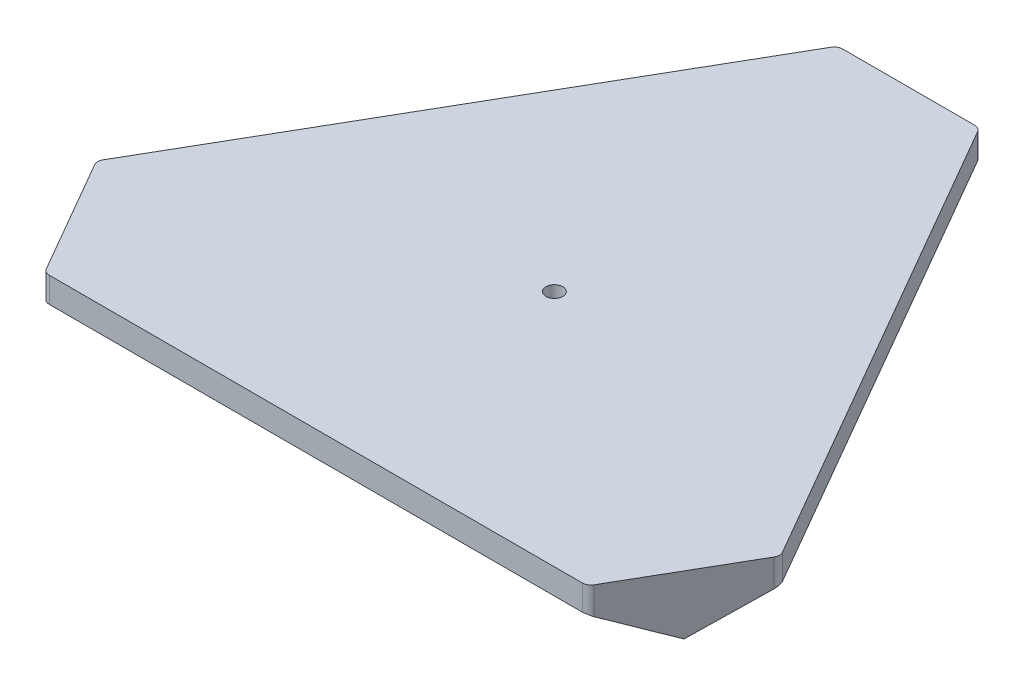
ISO-10303-21;
HEADER;
FILE_DESCRIPTION(('STEP AP214'),'2;1');
FILE_NAME('part.step','',(''),(''),'','','');
FILE_SCHEMA(('AUTOMOTIVE_DESIGN { 1 0 10303 214 1 1 1 1 }'));
ENDSEC;
DATA;
#1=APPLICATION_CONTEXT('core data for automotive mechanical design processes');
#2=APPLICATION_PROTOCOL_DEFINITION('international standard','automotive_design',2000,#1);
#3=PRODUCT_CONTEXT('',#1,'mechanical');
#4=PRODUCT('Part','Part','',(#3));
#5=PRODUCT_RELATED_PRODUCT_CATEGORY('part','',(#4));
#6=PRODUCT_DEFINITION_FORMATION('','',#4);
#7=PRODUCT_DEFINITION_CONTEXT('part definition',#1,'design');
#8=PRODUCT_DEFINITION('design','',#6,#7);
#9=PRODUCT_DEFINITION_SHAPE('','',#8);
#10=(LENGTH_UNIT() NAMED_UNIT(*) SI_UNIT(.MILLI.,.METRE.));
#11=(NAMED_UNIT(*) PLANE_ANGLE_UNIT() SI_UNIT($,.RADIAN.));
#12=(NAMED_UNIT(*) SI_UNIT($,.STERADIAN.) SOLID_ANGLE_UNIT());
#13=UNCERTAINTY_MEASURE_WITH_UNIT(LENGTH_MEASURE(1.E-05),#10,'distance_accuracy_value','');
#14=(GEOMETRIC_REPRESENTATION_CONTEXT(3) GLOBAL_UNCERTAINTY_ASSIGNED_CONTEXT((#13)) GLOBAL_UNIT_ASSIGNED_CONTEXT((#10,
#11,#12)) REPRESENTATION_CONTEXT('',''));
#15=CARTESIAN_POINT('',(0.,0.,0.));
#16=DIRECTION('',(0.,0.,1.));
#17=DIRECTION('',(1.,0.,0.));
#18=AXIS2_PLACEMENT_3D('',#15,#16,#17);
#19=CARTESIAN_POINT('',(245.,0.,141.450815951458));
#20=DIRECTION('',(0.,1.,0.));
#21=DIRECTION('',(0.,0.,1.));
#22=AXIS2_PLACEMENT_3D('',#19,#20,#21);
#23=PLANE('',#22);
#24=DIRECTION('',(-0.866025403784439,0.,0.499999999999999));
#25=VECTOR('',#24,1.);
#26=CARTESIAN_POINT('',(143.838911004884,0.,-33.7653299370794));
#27=LINE('',#26,#25);
#28=CARTESIAN_POINT('',(-159.367466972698,0.,141.290954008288));
#29=VERTEX_POINT('',#28);
#30=CARTESIAN_POINT('',(-123.421996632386,0.,120.537827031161));
#31=VERTEX_POINT('',#30);
#32=EDGE_CURVE('E299',#29,#31,#27,.F.);
#33=ORIENTED_EDGE('',*,*,#32,.T.);
#34=DIRECTION('',(-1.,0.,0.));
#35=VECTOR('',#34,1.);
#36=CARTESIAN_POINT('',(-123.421996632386,0.,120.537827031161));
#37=LINE('',#36,#35);
#38=CARTESIAN_POINT('',(123.421996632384,0.,120.537827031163));
#39=VERTEX_POINT('',#38);
#40=EDGE_CURVE('E368',#39,#31,#37,.T.);
#41=ORIENTED_EDGE('',*,*,#40,.F.);
#42=DIRECTION('',(0.866025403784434,0.,0.500000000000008));
#43=VECTOR('',#42,1.);
#44=CARTESIAN_POINT('',(223.661088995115,0.,178.41089399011));
#45=LINE('',#44,#43);
#46=CARTESIAN_POINT('',(159.367466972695,0.,141.290954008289));
#47=VERTEX_POINT('',#46);
#48=EDGE_CURVE('E336',#39,#47,#45,.T.);
#49=ORIENTED_EDGE('',*,*,#48,.T.);
#50=CARTESIAN_POINT('',(158.113248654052,0.,136.450815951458));
#51=DIRECTION('',(0.,1.,0.));
#52=DIRECTION('',(0.,0.,1.));
#53=AXIS2_PLACEMENT_3D('',#50,#51,#52);
#54=CIRCLE('',#53,5.);
#55=CARTESIAN_POINT('',(158.113248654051,0.,141.450815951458));
#56=VERTEX_POINT('',#55);
#57=EDGE_CURVE('E380',#47,#56,#54,.F.);
#58=ORIENTED_EDGE('',*,*,#57,.T.);
#59=DIRECTION('',(1.,0.,0.));
#60=VECTOR('',#59,1.);
#61=CARTESIAN_POINT('',(-245.,0.,141.450815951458));
#62=LINE('',#61,#60);
#63=CARTESIAN_POINT('',(-158.113248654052,0.,141.450815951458));
#64=VERTEX_POINT('',#63);
#65=EDGE_CURVE('E748',#64,#56,#62,.T.);
#66=ORIENTED_EDGE('',*,*,#65,.F.);
#67=CARTESIAN_POINT('',(-158.113248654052,0.,136.450815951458));
#68=DIRECTION('',(0.,1.,0.));
#69=DIRECTION('',(0.,0.,1.));
#70=AXIS2_PLACEMENT_3D('',#67,#68,#69);
#71=CIRCLE('',#70,5.);
#72=EDGE_CURVE('E376',#64,#29,#71,.F.);
#73=ORIENTED_EDGE('',*,*,#72,.T.);
#74=EDGE_LOOP('',(#33,#41,#49,#58,#66,#73));
#75=FACE_BOUND('',#74,.T.);
#76=ADVANCED_FACE('F32',(#75),#23,.F.);
#77=DIRECTION('',(0.866025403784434,0.,0.500000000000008));
#78=VECTOR('',#77,1.);
#79=CARTESIAN_POINT('',(266.338911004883,0.,104.490737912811));
#80=LINE('',#79,#78);
#81=CARTESIAN_POINT('',(202.045288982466,0.,67.3707979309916));
#82=VERTEX_POINT('',#81);
#83=CARTESIAN_POINT('',(166.099818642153,0.,46.6176709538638));
#84=VERTEX_POINT('',#83);
#85=EDGE_CURVE('E350',#82,#84,#80,.F.);
#86=ORIENTED_EDGE('',*,*,#85,.T.);
#87=DIRECTION('',(0.499999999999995,0.,0.866025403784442));
#88=VECTOR('',#87,1.);
#89=CARTESIAN_POINT('',(166.099818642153,0.,46.6176709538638));
#90=LINE('',#89,#88);
#91=CARTESIAN_POINT('',(42.6778220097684,0.,-167.155497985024));
#92=VERTEX_POINT('',#91);
#93=EDGE_CURVE('E261',#92,#84,#90,.T.);
#94=ORIENTED_EDGE('',*,*,#93,.F.);
#95=DIRECTION('',(0.,0.,-1.));
#96=VECTOR('',#95,1.);
#97=CARTESIAN_POINT('',(42.6778220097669,0.,141.450815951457));
#98=LINE('',#97,#96);
#99=CARTESIAN_POINT('',(42.6778220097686,0.,-208.661751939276));
#100=VERTEX_POINT('',#99);
#101=EDGE_CURVE('E314',#92,#100,#98,.T.);
#102=ORIENTED_EDGE('',*,*,#101,.T.);
#103=CARTESIAN_POINT('',(39.113248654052,0.,-205.155497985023));
#104=DIRECTION('',(0.,1.,0.));
#105=DIRECTION('',(0.,0.,1.));
#106=AXIS2_PLACEMENT_3D('',#103,#104,#105);
#107=CIRCLE('',#106,5.);
#108=CARTESIAN_POINT('',(43.4433756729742,0.,-207.655497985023));
#109=VERTEX_POINT('',#108);
#110=EDGE_CURVE('E384',#100,#109,#107,.F.);
#111=ORIENTED_EDGE('',*,*,#110,.T.);
#112=DIRECTION('',(-0.5,0.,-0.866025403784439));
#113=VECTOR('',#112,1.);
#114=CARTESIAN_POINT('',(245.,0.,141.450815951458));
#115=LINE('',#114,#113);
#116=CARTESIAN_POINT('',(201.556624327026,0.,66.2046820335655));
#117=VERTEX_POINT('',#116);
#118=EDGE_CURVE('E760',#117,#109,#115,.T.);
#119=ORIENTED_EDGE('',*,*,#118,.F.);
#120=CARTESIAN_POINT('',(197.226497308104,0.,68.7046820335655));
#121=DIRECTION('',(0.,1.,0.));
#122=DIRECTION('',(0.,0.,1.));
#123=AXIS2_PLACEMENT_3D('',#120,#121,#122);
#124=CIRCLE('',#123,5.);
#125=EDGE_CURVE('E382',#117,#82,#124,.F.);
#126=ORIENTED_EDGE('',*,*,#125,.T.);
#127=EDGE_LOOP('',(#86,#94,#102,#111,#119,#126));
#128=FACE_BOUND('',#127,.T.);
#129=ADVANCED_FACE('F483',(#128),#23,.F.);
#130=DIRECTION('',(0.,0.,-1.));
#131=VECTOR('',#130,1.);
#132=CARTESIAN_POINT('',(-42.6778220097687,0.,141.450815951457));
#133=LINE('',#132,#131);
#134=CARTESIAN_POINT('',(-42.6778220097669,0.,-208.661751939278));
#135=VERTEX_POINT('',#134);
#136=CARTESIAN_POINT('',(-42.6778220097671,0.,-167.155497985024));
#137=VERTEX_POINT('',#136);
#138=EDGE_CURVE('E256',#135,#137,#133,.F.);
#139=ORIENTED_EDGE('',*,*,#138,.T.);
#140=DIRECTION('',(0.500000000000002,0.,-0.866025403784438));
#141=VECTOR('',#140,1.);
#142=CARTESIAN_POINT('',(-42.6778220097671,0.,-167.155497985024));
#143=LINE('',#142,#141);
#144=CARTESIAN_POINT('',(-166.099818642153,0.,46.6176709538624));
#145=VERTEX_POINT('',#144);
#146=EDGE_CURVE('E249',#145,#137,#143,.T.);
#147=ORIENTED_EDGE('',*,*,#146,.F.);
#148=DIRECTION('',(-0.866025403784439,0.,0.499999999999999));
#149=VECTOR('',#148,1.);
#150=CARTESIAN_POINT('',(101.161088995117,0.,-107.685486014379));
#151=LINE('',#150,#149);
#152=CARTESIAN_POINT('',(-202.045288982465,0.,67.3707979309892));
#153=VERTEX_POINT('',#152);
#154=EDGE_CURVE('E253',#145,#153,#151,.T.);
#155=ORIENTED_EDGE('',*,*,#154,.T.);
#156=CARTESIAN_POINT('',(-197.226497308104,0.,68.7046820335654));
#157=DIRECTION('',(0.,1.,0.));
#158=DIRECTION('',(0.,0.,1.));
#159=AXIS2_PLACEMENT_3D('',#156,#157,#158);
#160=CIRCLE('',#159,5.);
#161=CARTESIAN_POINT('',(-201.556624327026,0.,66.2046820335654));
#162=VERTEX_POINT('',#161);
#163=EDGE_CURVE('E378',#153,#162,#160,.F.);
#164=ORIENTED_EDGE('',*,*,#163,.T.);
#165=DIRECTION('',(-0.5,0.,0.866025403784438));
#166=VECTOR('',#165,1.);
#167=CARTESIAN_POINT('',(0.,0.,-282.901631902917));
#168=LINE('',#167,#166);
#169=CARTESIAN_POINT('',(-43.4433756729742,0.,-207.655497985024));
#170=VERTEX_POINT('',#169);
#171=EDGE_CURVE('E753',#170,#162,#168,.T.);
#172=ORIENTED_EDGE('',*,*,#171,.F.);
#173=CARTESIAN_POINT('',(-39.113248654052,0.,-205.155497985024));
#174=DIRECTION('',(0.,1.,0.));
#175=DIRECTION('',(0.,0.,1.));
#176=AXIS2_PLACEMENT_3D('',#173,#174,#175);
#177=CIRCLE('',#176,5.);
#178=EDGE_CURVE('E386',#170,#135,#177,.F.);
#179=ORIENTED_EDGE('',*,*,#178,.T.);
#180=EDGE_LOOP('',(#139,#147,#155,#164,#172,#179));
#181=FACE_BOUND('',#180,.T.);
#182=ADVANCED_FACE('F251',(#181),#23,.F.);
#183=CARTESIAN_POINT('',(245.,15.,141.450815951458));
#184=DIRECTION('',(0.,1.,0.));
#185=DIRECTION('',(0.,0.,1.));
#186=AXIS2_PLACEMENT_3D('',#183,#184,#185);
#187=PLANE('',#186);
#188=DIRECTION('',(1.,0.,0.));
#189=VECTOR('',#188,1.);
#190=CARTESIAN_POINT('',(245.,15.,-210.155497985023));
#191=LINE('',#190,#189);
#192=CARTESIAN_POINT('',(39.113248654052,15.,-210.155497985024));
#193=VERTEX_POINT('',#192);
#194=CARTESIAN_POINT('',(-39.113248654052,15.,-210.155497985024));
#195=VERTEX_POINT('',#194);
#196=EDGE_CURVE('E757',#193,#195,#191,.F.);
#197=ORIENTED_EDGE('',*,*,#196,.T.);
#198=CARTESIAN_POINT('',(-39.113248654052,15.,-205.155497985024));
#199=DIRECTION('',(0.,1.,0.));
#200=DIRECTION('',(0.,0.,1.));
#201=AXIS2_PLACEMENT_3D('',#198,#199,#200);
#202=CIRCLE('',#201,5.);
#203=CARTESIAN_POINT('',(-43.4433756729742,15.,-207.655497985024));
#204=VERTEX_POINT('',#203);
#205=EDGE_CURVE('E660',#195,#204,#202,.T.);
#206=ORIENTED_EDGE('',*,*,#205,.T.);
#207=DIRECTION('',(-0.5,0.,0.866025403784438));
#208=VECTOR('',#207,1.);
#209=CARTESIAN_POINT('',(0.,15.,-282.901631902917));
#210=LINE('',#209,#208);
#211=CARTESIAN_POINT('',(-201.556624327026,15.,66.2046820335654));
#212=VERTEX_POINT('',#211);
#213=EDGE_CURVE('E755',#204,#212,#210,.T.);
#214=ORIENTED_EDGE('',*,*,#213,.T.);
#215=CARTESIAN_POINT('',(-197.226497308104,15.,68.7046820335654));
#216=DIRECTION('',(0.,1.,0.));
#217=DIRECTION('',(0.,0.,1.));
#218=AXIS2_PLACEMENT_3D('',#215,#216,#217);
#219=CIRCLE('',#218,5.);
#220=CARTESIAN_POINT('',(-201.556624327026,15.,71.2046820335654));
#221=VERTEX_POINT('',#220);
#222=EDGE_CURVE('E696',#212,#221,#219,.T.);
#223=ORIENTED_EDGE('',*,*,#222,.T.);
#224=DIRECTION('',(-0.499999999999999,0.,-0.866025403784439));
#225=VECTOR('',#224,1.);
#226=CARTESIAN_POINT('',(-59.5000000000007,15.,317.253972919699));
#227=LINE('',#226,#225);
#228=CARTESIAN_POINT('',(-162.443375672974,15.,138.950815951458));
#229=VERTEX_POINT('',#228);
#230=EDGE_CURVE('E284',#221,#229,#227,.F.);
#231=ORIENTED_EDGE('',*,*,#230,.T.);
#232=CARTESIAN_POINT('',(-158.113248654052,15.,136.450815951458));
#233=DIRECTION('',(0.,1.,0.));
#234=DIRECTION('',(0.,0.,1.));
#235=AXIS2_PLACEMENT_3D('',#232,#233,#234);
#236=CIRCLE('',#235,5.);
#237=CARTESIAN_POINT('',(-158.113248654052,15.,141.450815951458));
#238=VERTEX_POINT('',#237);
#239=EDGE_CURVE('E698',#229,#238,#236,.T.);
#240=ORIENTED_EDGE('',*,*,#239,.T.);
#241=DIRECTION('',(1.,0.,0.));
#242=VECTOR('',#241,1.);
#243=CARTESIAN_POINT('',(-245.,15.,141.450815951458));
#244=LINE('',#243,#242);
#245=CARTESIAN_POINT('',(158.113248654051,15.,141.450815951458));
#246=VERTEX_POINT('',#245);
#247=EDGE_CURVE('E749',#238,#246,#244,.T.);
#248=ORIENTED_EDGE('',*,*,#247,.T.);
#249=CARTESIAN_POINT('',(158.113248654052,15.,136.450815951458));
#250=DIRECTION('',(0.,1.,0.));
#251=DIRECTION('',(0.,0.,1.));
#252=AXIS2_PLACEMENT_3D('',#249,#250,#251);
#253=CIRCLE('',#252,5.);
#254=CARTESIAN_POINT('',(162.443375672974,15.,138.950815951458));
#255=VERTEX_POINT('',#254);
#256=EDGE_CURVE('E694',#246,#255,#253,.T.);
#257=ORIENTED_EDGE('',*,*,#256,.T.);
#258=DIRECTION('',(-0.500000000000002,0.,0.866025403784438));
#259=VECTOR('',#258,1.);
#260=CARTESIAN_POINT('',(182.,15.,105.077748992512));
#261=LINE('',#260,#259);
#262=CARTESIAN_POINT('',(201.556624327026,15.,71.2046820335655));
#263=VERTEX_POINT('',#262);
#264=EDGE_CURVE('E765',#255,#263,#261,.F.);
#265=ORIENTED_EDGE('',*,*,#264,.T.);
#266=CARTESIAN_POINT('',(197.226497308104,15.,68.7046820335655));
#267=DIRECTION('',(0.,1.,0.));
#268=DIRECTION('',(0.,0.,1.));
#269=AXIS2_PLACEMENT_3D('',#266,#267,#268);
#270=CIRCLE('',#269,5.);
#271=CARTESIAN_POINT('',(201.556624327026,15.,66.2046820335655));
#272=VERTEX_POINT('',#271);
#273=EDGE_CURVE('E690',#263,#272,#270,.T.);
#274=ORIENTED_EDGE('',*,*,#273,.T.);
#275=DIRECTION('',(-0.5,0.,-0.866025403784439));
#276=VECTOR('',#275,1.);
#277=CARTESIAN_POINT('',(245.,15.,141.450815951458));
#278=LINE('',#277,#276);
#279=CARTESIAN_POINT('',(43.4433756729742,15.,-207.655497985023));
#280=VERTEX_POINT('',#279);
#281=EDGE_CURVE('E752',#272,#280,#278,.T.);
#282=ORIENTED_EDGE('',*,*,#281,.T.);
#283=CARTESIAN_POINT('',(39.113248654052,15.,-205.155497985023));
#284=DIRECTION('',(0.,1.,0.));
#285=DIRECTION('',(0.,0.,1.));
#286=AXIS2_PLACEMENT_3D('',#283,#284,#285);
#287=CIRCLE('',#286,5.);
#288=EDGE_CURVE('E651',#280,#193,#287,.T.);
#289=ORIENTED_EDGE('',*,*,#288,.T.);
#290=EDGE_LOOP('',(#197,#206,#214,#223,#231,#240,#248,#257,#265,#274,#282,#289));
#291=FACE_BOUND('',#290,.T.);
#292=CARTESIAN_POINT('',(0.,15.,0.));
#293=DIRECTION('',(0.,1.,0.));
#294=DIRECTION('',(0.,0.,1.));
#295=AXIS2_PLACEMENT_3D('',#292,#293,#294);
#296=CIRCLE('',#295,5.);
#297=CARTESIAN_POINT('',(0.,15.,5.));
#298=VERTEX_POINT('',#297);
#299=EDGE_CURVE('E745',#298,#298,#296,.T.);
#300=ORIENTED_EDGE('',*,*,#299,.F.);
#301=EDGE_LOOP('',(#300));
#302=FACE_BOUND('',#301,.T.);
#303=ADVANCED_FACE('F493',(#291,#302),#187,.T.);
#304=CARTESIAN_POINT('',(-245.,15.,141.450815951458));
#305=DIRECTION('',(0.,0.,-1.));
#306=DIRECTION('',(-1.,0.,0.));
#307=AXIS2_PLACEMENT_3D('',#304,#305,#306);
#308=PLANE('',#307);
#309=ORIENTED_EDGE('',*,*,#65,.T.);
#310=DIRECTION('',(0.,-1.,0.));
#311=VECTOR('',#310,1.);
#312=CARTESIAN_POINT('',(158.113248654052,15.,141.450815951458));
#313=LINE('',#312,#311);
#314=EDGE_CURVE('E780',#56,#246,#313,.F.);
#315=ORIENTED_EDGE('',*,*,#314,.T.);
#316=ORIENTED_EDGE('',*,*,#247,.F.);
#317=DIRECTION('',(0.,1.,0.));
#318=VECTOR('',#317,1.);
#319=CARTESIAN_POINT('',(-158.113248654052,-0.0775768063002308,141.450815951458));
#320=LINE('',#319,#318);
#321=EDGE_CURVE('E777',#238,#64,#320,.F.);
#322=ORIENTED_EDGE('',*,*,#321,.T.);
#323=EDGE_LOOP('',(#309,#315,#316,#322));
#324=FACE_BOUND('',#323,.T.);
#325=ADVANCED_FACE('F497',(#324),#308,.F.);
#326=CARTESIAN_POINT('',(245.,15.,141.450815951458));
#327=DIRECTION('',(-0.866025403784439,0.,0.5));
#328=DIRECTION('',(0.5,0.,0.866025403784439));
#329=AXIS2_PLACEMENT_3D('',#326,#327,#328);
#330=PLANE('',#329);
#331=ORIENTED_EDGE('',*,*,#118,.T.);
#332=DIRECTION('',(0.,-1.,0.));
#333=VECTOR('',#332,1.);
#334=CARTESIAN_POINT('',(43.4433756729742,15.,-207.655497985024));
#335=LINE('',#334,#333);
#336=EDGE_CURVE('E649',#109,#280,#335,.F.);
#337=ORIENTED_EDGE('',*,*,#336,.T.);
#338=ORIENTED_EDGE('',*,*,#281,.F.);
#339=DIRECTION('',(0.,1.,0.));
#340=VECTOR('',#339,1.);
#341=CARTESIAN_POINT('',(201.556624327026,-0.0775768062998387,66.2046820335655));
#342=LINE('',#341,#340);
#343=EDGE_CURVE('E656',#272,#117,#342,.F.);
#344=ORIENTED_EDGE('',*,*,#343,.T.);
#345=EDGE_LOOP('',(#331,#337,#338,#344));
#346=FACE_BOUND('',#345,.T.);
#347=ADVANCED_FACE('F502',(#346),#330,.F.);
#348=CARTESIAN_POINT('',(0.,15.,-282.901631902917));
#349=DIRECTION('',(0.866025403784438,0.,0.5));
#350=DIRECTION('',(0.5,0.,-0.866025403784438));
#351=AXIS2_PLACEMENT_3D('',#348,#349,#350);
#352=PLANE('',#351);
#353=ORIENTED_EDGE('',*,*,#213,.F.);
#354=DIRECTION('',(0.,1.,0.));
#355=VECTOR('',#354,1.);
#356=CARTESIAN_POINT('',(-43.4433756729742,-0.0775768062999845,-207.655497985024));
#357=LINE('',#356,#355);
#358=EDGE_CURVE('E373',#204,#170,#357,.F.);
#359=ORIENTED_EDGE('',*,*,#358,.T.);
#360=ORIENTED_EDGE('',*,*,#171,.T.);
#361=DIRECTION('',(0.,-1.,0.));
#362=VECTOR('',#361,1.);
#363=CARTESIAN_POINT('',(-201.556624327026,15.,66.2046820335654));
#364=LINE('',#363,#362);
#365=EDGE_CURVE('E364',#162,#212,#364,.F.);
#366=ORIENTED_EDGE('',*,*,#365,.T.);
#367=EDGE_LOOP('',(#353,#359,#360,#366));
#368=FACE_BOUND('',#367,.T.);
#369=ADVANCED_FACE('F512',(#368),#352,.F.);
#370=CARTESIAN_POINT('',(0.,15.,0.));
#371=DIRECTION('',(0.,-1.,0.));
#372=DIRECTION('',(0.,0.,-1.));
#373=AXIS2_PLACEMENT_3D('',#370,#371,#372);
#374=CYLINDRICAL_SURFACE('',#373,5.);
#375=CARTESIAN_POINT('',(0.,8.,0.));
#376=DIRECTION('',(0.,1.,0.));
#377=DIRECTION('',(0.,0.,1.));
#378=AXIS2_PLACEMENT_3D('',#375,#376,#377);
#379=CIRCLE('',#378,5.);
#380=CARTESIAN_POINT('',(0.,8.,5.));
#381=VERTEX_POINT('',#380);
#382=EDGE_CURVE('E11',#381,#381,#379,.F.);
#383=ORIENTED_EDGE('',*,*,#382,.T.);
#384=EDGE_LOOP('',(#383));
#385=FACE_BOUND('',#384,.T.);
#386=ORIENTED_EDGE('',*,*,#299,.T.);
#387=EDGE_LOOP('',(#386));
#388=FACE_BOUND('',#387,.T.);
#389=ADVANCED_FACE('F508',(#385,#388),#374,.F.);
#390=CARTESIAN_POINT('',(-161.,15.,141.450815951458));
#391=DIRECTION('',(0.866025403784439,0.,-0.499999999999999));
#392=DIRECTION('',(-0.499999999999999,0.,-0.866025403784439));
#393=AXIS2_PLACEMENT_3D('',#390,#391,#392);
#394=PLANE('',#393);
#395=ORIENTED_EDGE('',*,*,#230,.F.);
#396=DIRECTION('',(0.,1.,0.));
#397=VECTOR('',#396,1.);
#398=CARTESIAN_POINT('',(-201.556624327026,-0.0775768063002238,71.2046820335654));
#399=LINE('',#398,#397);
#400=CARTESIAN_POINT('',(-201.556624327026,-1.37464349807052,71.2046820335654));
#401=VERTEX_POINT('',#400);
#402=EDGE_CURVE('E1210',#221,#401,#399,.F.);
#403=ORIENTED_EDGE('',*,*,#402,.T.);
#404=DIRECTION('',(0.451430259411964,-0.42993358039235,0.781900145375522));
#405=VECTOR('',#404,1.);
#406=CARTESIAN_POINT('',(-203.,0.,68.7046820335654));
#407=LINE('',#406,#405);
#408=CARTESIAN_POINT('',(-182.,-20.,105.077748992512));
#409=VERTEX_POINT('',#408);
#410=EDGE_CURVE('E732',#401,#409,#407,.T.);
#411=ORIENTED_EDGE('',*,*,#410,.T.);
#412=DIRECTION('',(0.451430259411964,0.429933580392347,0.781900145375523));
#413=VECTOR('',#412,1.);
#414=CARTESIAN_POINT('',(-182.,-20.,105.077748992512));
#415=LINE('',#414,#413);
#416=CARTESIAN_POINT('',(-162.443375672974,-1.37464349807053,138.950815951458));
#417=VERTEX_POINT('',#416);
#418=EDGE_CURVE('E736',#409,#417,#415,.T.);
#419=ORIENTED_EDGE('',*,*,#418,.T.);
#420=DIRECTION('',(0.,-1.,0.));
#421=VECTOR('',#420,1.);
#422=CARTESIAN_POINT('',(-162.443375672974,15.,138.950815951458));
#423=LINE('',#422,#421);
#424=EDGE_CURVE('E429',#417,#229,#423,.F.);
#425=ORIENTED_EDGE('',*,*,#424,.T.);
#426=EDGE_LOOP('',(#395,#403,#411,#419,#425));
#427=FACE_BOUND('',#426,.T.);
#428=ADVANCED_FACE('F511',(#427),#394,.F.);
#429=CARTESIAN_POINT('',(203.,15.,68.7046820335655));
#430=DIRECTION('',(-0.866025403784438,0.,-0.500000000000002));
#431=DIRECTION('',(-0.500000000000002,0.,0.866025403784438));
#432=AXIS2_PLACEMENT_3D('',#429,#430,#431);
#433=PLANE('',#432);
#434=DIRECTION('',(0.451430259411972,0.429933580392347,-0.781900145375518));
#435=VECTOR('',#434,1.);
#436=CARTESIAN_POINT('',(181.999999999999,-20.,105.077748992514));
#437=LINE('',#436,#435);
#438=CARTESIAN_POINT('',(181.999999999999,-20.,105.077748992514));
#439=VERTEX_POINT('',#438);
#440=CARTESIAN_POINT('',(201.556624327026,-1.37464349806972,71.2046820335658));
#441=VERTEX_POINT('',#440);
#442=EDGE_CURVE('E804',#439,#441,#437,.T.);
#443=ORIENTED_EDGE('',*,*,#442,.T.);
#444=DIRECTION('',(0.,-1.,0.));
#445=VECTOR('',#444,1.);
#446=CARTESIAN_POINT('',(201.556624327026,15.,71.2046820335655));
#447=LINE('',#446,#445);
#448=EDGE_CURVE('E781',#441,#263,#447,.F.);
#449=ORIENTED_EDGE('',*,*,#448,.T.);
#450=ORIENTED_EDGE('',*,*,#264,.F.);
#451=DIRECTION('',(0.,1.,0.));
#452=VECTOR('',#451,1.);
#453=CARTESIAN_POINT('',(162.443375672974,-0.0775768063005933,138.950815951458));
#454=LINE('',#453,#452);
#455=CARTESIAN_POINT('',(162.443375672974,-1.37464349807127,138.950815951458));
#456=VERTEX_POINT('',#455);
#457=EDGE_CURVE('E784',#255,#456,#454,.F.);
#458=ORIENTED_EDGE('',*,*,#457,.T.);
#459=DIRECTION('',(0.451430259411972,-0.42993358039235,-0.781900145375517));
#460=VECTOR('',#459,1.);
#461=CARTESIAN_POINT('',(160.999999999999,0.,141.45081595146));
#462=LINE('',#461,#460);
#463=EDGE_CURVE('E819',#456,#439,#462,.T.);
#464=ORIENTED_EDGE('',*,*,#463,.T.);
#465=EDGE_LOOP('',(#443,#449,#450,#458,#464));
#466=FACE_BOUND('',#465,.T.);
#467=ADVANCED_FACE('F802',(#466),#433,.F.);
#468=CARTESIAN_POINT('',(-42.0000000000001,15.,-210.155497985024));
#469=DIRECTION('',(0.,0.,1.));
#470=DIRECTION('',(1.,0.,0.));
#471=AXIS2_PLACEMENT_3D('',#468,#469,#470);
#472=PLANE('',#471);
#473=DIRECTION('',(-0.902860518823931,0.429933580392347,0.));
#474=VECTOR('',#473,1.);
#475=CARTESIAN_POINT('',(1.0547118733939E-12,-20.,-210.155497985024));
#476=LINE('',#475,#474);
#477=CARTESIAN_POINT('',(1.0547118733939E-12,-20.,-210.155497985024));
#478=VERTEX_POINT('',#477);
#479=CARTESIAN_POINT('',(-39.113248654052,-1.37464349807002,-210.155497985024));
#480=VERTEX_POINT('',#479);
#481=EDGE_CURVE('E708',#478,#480,#476,.T.);
#482=ORIENTED_EDGE('',*,*,#481,.T.);
#483=DIRECTION('',(0.,-1.,0.));
#484=VECTOR('',#483,1.);
#485=CARTESIAN_POINT('',(-39.113248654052,15.,-210.155497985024));
#486=LINE('',#485,#484);
#487=EDGE_CURVE('E687',#480,#195,#486,.F.);
#488=ORIENTED_EDGE('',*,*,#487,.T.);
#489=ORIENTED_EDGE('',*,*,#196,.F.);
#490=DIRECTION('',(0.,1.,0.));
#491=VECTOR('',#490,1.);
#492=CARTESIAN_POINT('',(39.113248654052,-0.0775768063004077,-210.155497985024));
#493=LINE('',#492,#491);
#494=CARTESIAN_POINT('',(39.113248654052,-1.37464349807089,-210.155497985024));
#495=VERTEX_POINT('',#494);
#496=EDGE_CURVE('E700',#193,#495,#493,.F.);
#497=ORIENTED_EDGE('',*,*,#496,.T.);
#498=DIRECTION('',(-0.902860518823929,-0.42993358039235,0.));
#499=VECTOR('',#498,1.);
#500=CARTESIAN_POINT('',(42.0000000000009,0.,-210.155497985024));
#501=LINE('',#500,#499);
#502=EDGE_CURVE('E710',#495,#478,#501,.T.);
#503=ORIENTED_EDGE('',*,*,#502,.T.);
#504=EDGE_LOOP('',(#482,#488,#489,#497,#503));
#505=FACE_BOUND('',#504,.T.);
#506=ADVANCED_FACE('F522',(#505),#472,.F.);
#507=CARTESIAN_POINT('',(-147.358983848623,-20.,85.0777489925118));
#508=DIRECTION('',(0.214966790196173,-0.902860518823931,0.372333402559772));
#509=DIRECTION('',(0.,-0.381246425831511,-0.924473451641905));
#510=AXIS2_PLACEMENT_3D('',#507,#508,#509);
#511=PLANE('',#510);
#512=CARTESIAN_POINT('',(-154.062387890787,-9.88847234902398,113.467112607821));
#513=DIRECTION('',(0.214966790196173,-0.90286051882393,0.372333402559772));
#514=DIRECTION('',(0.,-0.381246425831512,-0.924473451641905));
#515=AXIS2_PLACEMENT_3D('',#512,#513,#514);
#516=CIRCLE('',#515,10.);
#517=CARTESIAN_POINT('',(-154.062387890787,-13.7009366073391,104.222378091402));
#518=VERTEX_POINT('',#517);
#519=EDGE_CURVE('E723',#518,#518,#516,.T.);
#520=ORIENTED_EDGE('',*,*,#519,.F.);
#521=EDGE_LOOP('',(#520));
#522=FACE_BOUND('',#521,.T.);
#523=DIRECTION('',(-0.866025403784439,0.,0.499999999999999));
#524=VECTOR('',#523,1.);
#525=CARTESIAN_POINT('',(-126.664973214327,-0.291418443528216,120.920826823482));
#526=LINE('',#525,#524);
#527=CARTESIAN_POINT('',(-125.183897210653,-0.291418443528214,120.065727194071));
#528=VERTEX_POINT('',#527);
#529=CARTESIAN_POINT('',(-160.831903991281,-0.291418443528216,140.64711350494));
#530=VERTEX_POINT('',#529);
#531=EDGE_CURVE('E306',#528,#530,#526,.T.);
#532=ORIENTED_EDGE('',*,*,#531,.T.);
#533=CARTESIAN_POINT('',(-158.113248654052,-1.37464349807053,136.450815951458));
#534=DIRECTION('',(0.214966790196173,-0.902860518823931,0.372333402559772));
#535=DIRECTION('',(-0.451430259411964,-0.429933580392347,-0.781900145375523));
#536=AXIS2_PLACEMENT_3D('',#533,#534,#535);
#537=ELLIPSE('',#536,5.53795397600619,5.);
#538=EDGE_CURVE('E613',#530,#417,#537,.T.);
#539=ORIENTED_EDGE('',*,*,#538,.T.);
#540=ORIENTED_EDGE('',*,*,#418,.F.);
#541=DIRECTION('',(-0.866025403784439,0.,0.499999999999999));
#542=VECTOR('',#541,1.);
#543=CARTESIAN_POINT('',(-147.358983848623,-20.,85.0777489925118));
#544=LINE('',#543,#542);
#545=CARTESIAN_POINT('',(-147.358983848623,-20.,85.0777489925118));
#546=VERTEX_POINT('',#545);
#547=EDGE_CURVE('E739',#546,#409,#544,.T.);
#548=ORIENTED_EDGE('',*,*,#547,.F.);
#549=DIRECTION('',(0.451430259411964,0.429933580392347,0.781900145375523));
#550=VECTOR('',#549,1.);
#551=CARTESIAN_POINT('',(-147.358983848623,-20.,85.0777489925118));
#552=LINE('',#551,#550);
#553=CARTESIAN_POINT('',(-129.508983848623,-3.,115.994855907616));
#554=VERTEX_POINT('',#553);
#555=EDGE_CURVE('E735',#546,#554,#552,.T.);
#556=ORIENTED_EDGE('',*,*,#555,.T.);
#557=CARTESIAN_POINT('',(-126.910907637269,-3.,114.494855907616));
#558=DIRECTION('',(0.214966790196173,-0.902860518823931,0.372333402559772));
#559=DIRECTION('',(0.451430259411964,0.429933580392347,0.781900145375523));
#560=AXIS2_PLACEMENT_3D('',#557,#558,#559);
#561=ELLIPSE('',#560,6.97782200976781,3.);
#562=EDGE_CURVE('E312',#554,#528,#561,.F.);
#563=ORIENTED_EDGE('',*,*,#562,.T.);
#564=EDGE_LOOP('',(#532,#539,#540,#548,#556,#563));
#565=FACE_BOUND('',#564,.T.);
#566=ADVANCED_FACE('F518',(#522,#565),#511,.T.);
#567=CARTESIAN_POINT('',(-168.358983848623,0.,48.7046820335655));
#568=DIRECTION('',(-0.214966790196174,-0.902860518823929,-0.372333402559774));
#569=DIRECTION('',(0.,0.381246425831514,-0.924473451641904));
#570=AXIS2_PLACEMENT_3D('',#567,#568,#569);
#571=PLANE('',#570);
#572=CARTESIAN_POINT('',(-175.296595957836,-9.88847234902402,76.6883853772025));
#573=DIRECTION('',(-0.214966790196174,-0.90286051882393,-0.372333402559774));
#574=DIRECTION('',(0.,0.381246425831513,-0.924473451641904));
#575=AXIS2_PLACEMENT_3D('',#572,#573,#574);
#576=CIRCLE('',#575,10.);
#577=CARTESIAN_POINT('',(-175.296595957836,-6.07600809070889,67.4436508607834));
#578=VERTEX_POINT('',#577);
#579=EDGE_CURVE('E729',#578,#578,#576,.T.);
#580=ORIENTED_EDGE('',*,*,#579,.F.);
#581=EDGE_LOOP('',(#580));
#582=FACE_BOUND('',#581,.T.);
#583=ORIENTED_EDGE('',*,*,#410,.F.);
#584=CARTESIAN_POINT('',(-197.226497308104,-1.37464349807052,68.7046820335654));
#585=DIRECTION('',(-0.214966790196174,-0.902860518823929,-0.372333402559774));
#586=DIRECTION('',(-0.451430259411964,0.42993358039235,-0.781900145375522));
#587=AXIS2_PLACEMENT_3D('',#584,#585,#586);
#588=ELLIPSE('',#587,5.5379539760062,5.);
#589=CARTESIAN_POINT('',(-202.219925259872,-0.291418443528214,68.9609578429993));
#590=VERTEX_POINT('',#589);
#591=EDGE_CURVE('E457',#401,#590,#588,.T.);
#592=ORIENTED_EDGE('',*,*,#591,.T.);
#593=DIRECTION('',(-0.866025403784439,0.,0.499999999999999));
#594=VECTOR('',#593,1.);
#595=CARTESIAN_POINT('',(-168.052994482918,-0.291418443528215,49.2346711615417));
#596=LINE('',#595,#594);
#597=CARTESIAN_POINT('',(-166.571918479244,-0.291418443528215,48.3795715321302));
#598=VERTEX_POINT('',#597);
#599=EDGE_CURVE('E309',#590,#598,#596,.F.);
#600=ORIENTED_EDGE('',*,*,#599,.T.);
#601=CARTESIAN_POINT('',(-162.610907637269,-3.,52.6606420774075));
#602=DIRECTION('',(-0.214966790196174,-0.902860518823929,-0.372333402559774));
#603=DIRECTION('',(0.451430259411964,-0.42993358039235,0.781900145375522));
#604=AXIS2_PLACEMENT_3D('',#601,#602,#603);
#605=ELLIPSE('',#604,6.97782200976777,3.);
#606=CARTESIAN_POINT('',(-165.208983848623,-3.,54.1606420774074));
#607=VERTEX_POINT('',#606);
#608=EDGE_CURVE('E275',#598,#607,#605,.F.);
#609=ORIENTED_EDGE('',*,*,#608,.T.);
#610=DIRECTION('',(0.451430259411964,-0.42993358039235,0.781900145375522));
#611=VECTOR('',#610,1.);
#612=CARTESIAN_POINT('',(-168.358983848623,0.,48.7046820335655));
#613=LINE('',#612,#611);
#614=EDGE_CURVE('E733',#607,#546,#613,.T.);
#615=ORIENTED_EDGE('',*,*,#614,.T.);
#616=ORIENTED_EDGE('',*,*,#547,.T.);
#617=EDGE_LOOP('',(#583,#592,#600,#609,#615,#616));
#618=FACE_BOUND('',#617,.T.);
#619=ADVANCED_FACE('F514',(#582,#618),#571,.T.);
#620=CARTESIAN_POINT('',(-168.358983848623,0.,48.7046820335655));
#621=DIRECTION('',(-0.866025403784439,0.,0.499999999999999));
#622=DIRECTION('',(0.499999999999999,0.,0.866025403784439));
#623=AXIS2_PLACEMENT_3D('',#620,#621,#622);
#624=PLANE('',#623);
#625=ORIENTED_EDGE('',*,*,#614,.F.);
#626=DIRECTION('',(-0.499999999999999,0.,-0.866025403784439));
#627=VECTOR('',#626,1.);
#628=CARTESIAN_POINT('',(-126.358983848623,-3.,121.450815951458));
#629=LINE('',#628,#627);
#630=EDGE_CURVE('E301',#607,#554,#629,.F.);
#631=ORIENTED_EDGE('',*,*,#630,.T.);
#632=ORIENTED_EDGE('',*,*,#555,.F.);
#633=EDGE_LOOP('',(#625,#631,#632));
#634=FACE_BOUND('',#633,.T.);
#635=ADVANCED_FACE('F517',(#634),#624,.F.);
#636=CARTESIAN_POINT('',(-174.221762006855,-5.37416975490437,78.5500523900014));
#637=DIRECTION('',(-0.214966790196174,-0.90286051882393,-0.372333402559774));
#638=DIRECTION('',(0.,0.381246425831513,-0.924473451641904));
#639=AXIS2_PLACEMENT_3D('',#636,#637,#638);
#640=CYLINDRICAL_SURFACE('',#639,10.);
#641=CARTESIAN_POINT('',(-174.221762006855,-5.37416975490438,78.5500523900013));
#642=DIRECTION('',(-0.214966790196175,-0.902860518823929,-0.372333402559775));
#643=DIRECTION('',(0.,0.381246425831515,-0.924473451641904));
#644=AXIS2_PLACEMENT_3D('',#641,#642,#643);
#645=CIRCLE('',#644,10.);
#646=CARTESIAN_POINT('',(-174.221762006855,-1.56170549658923,69.3053178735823));
#647=VERTEX_POINT('',#646);
#648=EDGE_CURVE('E726',#647,#647,#645,.T.);
#649=ORIENTED_EDGE('',*,*,#648,.F.);
#650=EDGE_LOOP('',(#649));
#651=FACE_BOUND('',#650,.T.);
#652=ORIENTED_EDGE('',*,*,#579,.T.);
#653=EDGE_LOOP('',(#652));
#654=FACE_BOUND('',#653,.T.);
#655=ADVANCED_FACE('F526',(#651,#654),#640,.F.);
#656=CARTESIAN_POINT('',(-174.221762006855,-5.37416975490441,78.5500523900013));
#657=DIRECTION('',(-0.214966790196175,-0.902860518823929,-0.372333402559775));
#658=DIRECTION('',(0.451430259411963,-0.429933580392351,0.781900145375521));
#659=AXIS2_PLACEMENT_3D('',#656,#657,#658);
#660=SPHERICAL_SURFACE('',#659,10.);
#661=ORIENTED_EDGE('',*,*,#648,.T.);
#662=EDGE_LOOP('',(#661));
#663=FACE_BOUND('',#662,.T.);
#664=ADVANCED_FACE('F530',(#663),#660,.F.);
#665=CARTESIAN_POINT('',(-155.137221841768,-5.37416975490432,111.605445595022));
#666=DIRECTION('',(0.214966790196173,-0.90286051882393,0.372333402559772));
#667=DIRECTION('',(0.,-0.381246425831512,-0.924473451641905));
#668=AXIS2_PLACEMENT_3D('',#665,#666,#667);
#669=CYLINDRICAL_SURFACE('',#668,10.);
#670=CARTESIAN_POINT('',(-155.137221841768,-5.37416975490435,111.605445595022));
#671=DIRECTION('',(0.214966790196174,-0.90286051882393,0.372333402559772));
#672=DIRECTION('',(0.,-0.381246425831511,-0.924473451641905));
#673=AXIS2_PLACEMENT_3D('',#670,#671,#672);
#674=CIRCLE('',#673,10.);
#675=CARTESIAN_POINT('',(-155.137221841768,-9.18663401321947,102.360711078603));
#676=VERTEX_POINT('',#675);
#677=EDGE_CURVE('E317',#676,#676,#674,.T.);
#678=ORIENTED_EDGE('',*,*,#677,.F.);
#679=EDGE_LOOP('',(#678));
#680=FACE_BOUND('',#679,.T.);
#681=ORIENTED_EDGE('',*,*,#519,.T.);
#682=EDGE_LOOP('',(#681));
#683=FACE_BOUND('',#682,.T.);
#684=ADVANCED_FACE('F534',(#680,#683),#669,.F.);
#685=CARTESIAN_POINT('',(-155.137221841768,-5.37416975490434,111.605445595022));
#686=DIRECTION('',(0.214966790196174,-0.90286051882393,0.372333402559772));
#687=DIRECTION('',(0.451430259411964,0.429933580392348,0.781900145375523));
#688=AXIS2_PLACEMENT_3D('',#685,#686,#687);
#689=SPHERICAL_SURFACE('',#688,10.);
#690=ORIENTED_EDGE('',*,*,#677,.T.);
#691=EDGE_LOOP('',(#690));
#692=FACE_BOUND('',#691,.T.);
#693=ADVANCED_FACE('F470',(#692),#689,.F.);
#694=CARTESIAN_POINT('',(-126.020072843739,-3.,122.037827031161));
#695=DIRECTION('',(-0.866025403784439,0.,0.499999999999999));
#696=DIRECTION('',(0.499999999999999,0.,0.866025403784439));
#697=AXIS2_PLACEMENT_3D('',#694,#695,#696);
#698=CYLINDRICAL_SURFACE('',#697,3.);
#699=ORIENTED_EDGE('',*,*,#32,.F.);
#700=CARTESIAN_POINT('',(-159.367466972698,0.,141.290954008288));
#701=CARTESIAN_POINT('',(-159.456156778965,2.62191358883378E-06,141.267987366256));
#702=CARTESIAN_POINT('',(-159.544244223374,-0.00206376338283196,141.242545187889));
#703=CARTESIAN_POINT('',(-159.718793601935,-0.0110237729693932,141.186910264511));
#704=CARTESIAN_POINT('',(-159.805252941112,-0.0179245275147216,141.156710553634));
#705=CARTESIAN_POINT('',(-159.973967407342,-0.0370322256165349,141.092550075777));
#706=CARTESIAN_POINT('',(-160.056273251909,-0.0491180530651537,141.058687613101));
#707=CARTESIAN_POINT('',(-160.218012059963,-0.0791446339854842,140.98709062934));
#708=CARTESIAN_POINT('',(-160.297447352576,-0.0970805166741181,140.94935934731));
#709=CARTESIAN_POINT('',(-160.454954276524,-0.139893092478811,140.869457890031));
#710=CARTESIAN_POINT('',(-160.532933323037,-0.164941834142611,140.827196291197));
#711=CARTESIAN_POINT('',(-160.685461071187,-0.222469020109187,140.739362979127));
#712=CARTESIAN_POINT('',(-160.759960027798,-0.255029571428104,140.693758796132));
#713=CARTESIAN_POINT('',(-160.831903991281,-0.291418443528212,140.64711350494));
#714=B_SPLINE_CURVE_WITH_KNOTS('',3,(#700,#701,#702,#703,#704,#705,#706,#707,#708,#709,#710,
#711,#712,#713),.UNSPECIFIED.,.F.,.F.,(4,2,2,2,2,2,4),(0.,0.274844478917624,0.550095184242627,
0.819239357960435,1.08816001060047,1.36423906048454,1.64349213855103),.UNSPECIFIED.);
#715=EDGE_CURVE('E456',#29,#530,#714,.T.);
#716=ORIENTED_EDGE('',*,*,#715,.T.);
#717=ORIENTED_EDGE('',*,*,#531,.F.);
#718=CARTESIAN_POINT('',(-123.421996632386,-3.,120.537827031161));
#719=DIRECTION('',(-0.258819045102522,0.,0.965925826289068));
#720=DIRECTION('',(-0.965925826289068,0.,-0.258819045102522));
#721=AXIS2_PLACEMENT_3D('',#718,#719,#720);
#722=ELLIPSE('',#721,4.24264068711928,3.);
#723=EDGE_CURVE('E278',#31,#528,#722,.T.);
#724=ORIENTED_EDGE('',*,*,#723,.F.);
#725=EDGE_LOOP('',(#699,#716,#717,#724));
#726=FACE_BOUND('',#725,.T.);
#727=ADVANCED_FACE('F466',(#726),#698,.F.);
#728=CARTESIAN_POINT('',(101.161088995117,-3.,-107.685486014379));
#729=DIRECTION('',(-0.866025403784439,0.,0.499999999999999));
#730=DIRECTION('',(0.499999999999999,0.,0.866025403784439));
#731=AXIS2_PLACEMENT_3D('',#728,#729,#730);
#732=CYLINDRICAL_SURFACE('',#731,3.);
#733=ORIENTED_EDGE('',*,*,#599,.F.);
#734=CARTESIAN_POINT('',(-202.219925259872,-0.291418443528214,68.9609578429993));
#735=CARTESIAN_POINT('',(-202.22427646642,-0.255620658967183,68.8767185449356));
#736=CARTESIAN_POINT('',(-202.226520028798,-0.223526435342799,68.7908404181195));
#737=CARTESIAN_POINT('',(-202.226474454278,-0.166401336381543,68.616848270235));
#738=CARTESIAN_POINT('',(-202.224189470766,-0.141364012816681,68.5287363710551));
#739=CARTESIAN_POINT('',(-202.214873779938,-0.0983841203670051,68.3529577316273));
#740=CARTESIAN_POINT('',(-202.207940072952,-0.0803081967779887,68.2653180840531));
#741=CARTESIAN_POINT('',(-202.189301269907,-0.0500283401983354,68.0895522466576));
#742=CARTESIAN_POINT('',(-202.177596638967,-0.0378238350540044,68.0014261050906));
#743=CARTESIAN_POINT('',(-202.148968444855,-0.0184188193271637,67.8228156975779));
#744=CARTESIAN_POINT('',(-202.131902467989,-0.0113748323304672,67.7323377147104));
#745=CARTESIAN_POINT('',(-202.092534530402,-0.00213757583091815,67.5512522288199));
#746=CARTESIAN_POINT('',(-202.070178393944,2.87711731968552E-06,67.460653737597));
#747=CARTESIAN_POINT('',(-202.045288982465,0.,67.3707979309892));
#748=B_SPLINE_CURVE_WITH_KNOTS('',3,(#734,#735,#736,#737,#738,#739,#740,#741,#742,#743,#744,
#745,#746,#747),.UNSPECIFIED.,.F.,.F.,(4,2,2,2,2,2,4),(0.,0.274730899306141,0.549209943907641,
0.818132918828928,1.08702968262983,1.36377827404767,1.64349401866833),.UNSPECIFIED.);
#749=EDGE_CURVE('E283',#590,#153,#748,.T.);
#750=ORIENTED_EDGE('',*,*,#749,.T.);
#751=ORIENTED_EDGE('',*,*,#154,.F.);
#752=CARTESIAN_POINT('',(-166.099818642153,-3.,46.6176709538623));
#753=DIRECTION('',(-0.965925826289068,0.,-0.258819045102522));
#754=DIRECTION('',(-0.258819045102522,0.,0.965925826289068));
#755=AXIS2_PLACEMENT_3D('',#752,#753,#754);
#756=ELLIPSE('',#755,4.24264068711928,3.);
#757=EDGE_CURVE('E267',#598,#145,#756,.T.);
#758=ORIENTED_EDGE('',*,*,#757,.F.);
#759=EDGE_LOOP('',(#733,#750,#751,#758));
#760=FACE_BOUND('',#759,.T.);
#761=ADVANCED_FACE('F281',(#760),#732,.F.);
#762=CARTESIAN_POINT('',(-22.2609076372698,-3.,295.753972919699));
#763=DIRECTION('',(0.499999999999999,0.,0.866025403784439));
#764=DIRECTION('',(0.866025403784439,0.,-0.499999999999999));
#765=AXIS2_PLACEMENT_3D('',#762,#763,#764);
#766=CYLINDRICAL_SURFACE('',#765,3.);
#767=ORIENTED_EDGE('',*,*,#562,.F.);
#768=ORIENTED_EDGE('',*,*,#630,.F.);
#769=ORIENTED_EDGE('',*,*,#608,.F.);
#770=ORIENTED_EDGE('',*,*,#757,.T.);
#771=DIRECTION('',(-0.499999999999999,0.,-0.866025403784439));
#772=VECTOR('',#771,1.);
#773=CARTESIAN_POINT('',(-165.760907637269,0.,47.2046820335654));
#774=LINE('',#773,#772);
#775=EDGE_CURVE('E272',#31,#145,#774,.T.);
#776=ORIENTED_EDGE('',*,*,#775,.F.);
#777=ORIENTED_EDGE('',*,*,#723,.T.);
#778=EDGE_LOOP('',(#767,#768,#769,#770,#776,#777));
#779=FACE_BOUND('',#778,.T.);
#780=ADVANCED_FACE('F269',(#779),#766,.F.);
#781=CARTESIAN_POINT('',(8.5043083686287E-13,-20.,-170.155497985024));
#782=DIRECTION('',(-0.429933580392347,-0.902860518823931,0.));
#783=DIRECTION('',(0.902860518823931,-0.429933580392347,0.));
#784=AXIS2_PLACEMENT_3D('',#781,#782,#783);
#785=PLANE('',#784);
#786=CARTESIAN_POINT('',(-21.2342080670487,-9.88847234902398,-190.155497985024));
#787=DIRECTION('',(-0.429933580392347,-0.90286051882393,0.));
#788=DIRECTION('',(0.800617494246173,-0.381246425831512,0.462236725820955));
#789=AXIS2_PLACEMENT_3D('',#786,#787,#788);
#790=CIRCLE('',#789,10.);
#791=CARTESIAN_POINT('',(-13.228033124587,-13.7009366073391,-185.533130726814));
#792=VERTEX_POINT('',#791);
#793=EDGE_CURVE('E846',#792,#792,#790,.T.);
#794=ORIENTED_EDGE('',*,*,#793,.F.);
#795=EDGE_LOOP('',(#794));
#796=FACE_BOUND('',#795,.T.);
#797=DIRECTION('',(0.,0.,-1.));
#798=VECTOR('',#797,1.);
#799=CARTESIAN_POINT('',(-41.38802126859,-0.291418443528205,-170.155497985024));
#800=LINE('',#799,#798);
#801=CARTESIAN_POINT('',(-41.38802126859,-0.291418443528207,-168.445298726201));
#802=VERTEX_POINT('',#801);
#803=CARTESIAN_POINT('',(-41.3880212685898,-0.291418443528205,-209.60807134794));
#804=VERTEX_POINT('',#803);
#805=EDGE_CURVE('E326',#802,#804,#800,.T.);
#806=ORIENTED_EDGE('',*,*,#805,.T.);
#807=CARTESIAN_POINT('',(-39.113248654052,-1.37464349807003,-205.155497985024));
#808=DIRECTION('',(-0.429933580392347,-0.902860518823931,0.));
#809=DIRECTION('',(0.902860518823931,-0.429933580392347,0.));
#810=AXIS2_PLACEMENT_3D('',#807,#808,#809);
#811=ELLIPSE('',#810,5.53795397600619,5.);
#812=EDGE_CURVE('E395',#804,#480,#811,.T.);
#813=ORIENTED_EDGE('',*,*,#812,.T.);
#814=ORIENTED_EDGE('',*,*,#481,.F.);
#815=DIRECTION('',(0.,0.,-1.));
#816=VECTOR('',#815,1.);
#817=CARTESIAN_POINT('',(8.5043083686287E-13,-20.,-170.155497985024));
#818=LINE('',#817,#816);
#819=CARTESIAN_POINT('',(8.5043083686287E-13,-20.,-170.155497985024));
#820=VERTEX_POINT('',#819);
#821=EDGE_CURVE('E279',#820,#478,#818,.T.);
#822=ORIENTED_EDGE('',*,*,#821,.F.);
#823=DIRECTION('',(-0.902860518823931,0.429933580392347,0.));
#824=VECTOR('',#823,1.);
#825=CARTESIAN_POINT('',(8.5043083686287E-13,-20.,-170.155497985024));
#826=LINE('',#825,#824);
#827=CARTESIAN_POINT('',(-35.6999999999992,-3.,-170.155497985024));
#828=VERTEX_POINT('',#827);
#829=EDGE_CURVE('E714',#820,#828,#826,.T.);
#830=ORIENTED_EDGE('',*,*,#829,.T.);
#831=CARTESIAN_POINT('',(-35.6999999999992,-3.,-167.155497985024));
#832=DIRECTION('',(-0.429933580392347,-0.902860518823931,0.));
#833=DIRECTION('',(-0.902860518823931,0.429933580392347,0.));
#834=AXIS2_PLACEMENT_3D('',#831,#832,#833);
#835=ELLIPSE('',#834,6.97782200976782,3.);
#836=EDGE_CURVE('E333',#828,#802,#835,.F.);
#837=ORIENTED_EDGE('',*,*,#836,.T.);
#838=EDGE_LOOP('',(#806,#813,#814,#822,#830,#837));
#839=FACE_BOUND('',#838,.T.);
#840=ADVANCED_FACE('F546',(#796,#839),#785,.T.);
#841=CARTESIAN_POINT('',(42.0000000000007,0.,-170.155497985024));
#842=DIRECTION('',(0.42993358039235,-0.902860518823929,0.));
#843=DIRECTION('',(0.90286051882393,0.42993358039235,0.));
#844=AXIS2_PLACEMENT_3D('',#841,#842,#843);
#845=PLANE('',#844);
#846=CARTESIAN_POINT('',(21.2342080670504,-9.88847234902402,-190.155497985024));
#847=DIRECTION('',(0.429933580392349,-0.90286051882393,0.));
#848=DIRECTION('',(0.800617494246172,0.381246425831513,0.462236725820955));
#849=AXIS2_PLACEMENT_3D('',#846,#847,#848);
#850=CIRCLE('',#849,10.);
#851=CARTESIAN_POINT('',(29.2403830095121,-6.07600809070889,-185.533130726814));
#852=VERTEX_POINT('',#851);
#853=EDGE_CURVE('E821',#852,#852,#850,.T.);
#854=ORIENTED_EDGE('',*,*,#853,.F.);
#855=EDGE_LOOP('',(#854));
#856=FACE_BOUND('',#855,.T.);
#857=ORIENTED_EDGE('',*,*,#502,.F.);
#858=CARTESIAN_POINT('',(39.113248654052,-1.37464349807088,-205.155497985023));
#859=DIRECTION('',(0.42993358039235,-0.902860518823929,0.));
#860=DIRECTION('',(0.90286051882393,0.42993358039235,0.));
#861=AXIS2_PLACEMENT_3D('',#858,#859,#860);
#862=ELLIPSE('',#861,5.5379539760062,5.);
#863=CARTESIAN_POINT('',(41.3880212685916,-0.291418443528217,-209.608071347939));
#864=VERTEX_POINT('',#863);
#865=EDGE_CURVE('E655',#495,#864,#862,.T.);
#866=ORIENTED_EDGE('',*,*,#865,.T.);
#867=DIRECTION('',(0.,0.,-1.));
#868=VECTOR('',#867,1.);
#869=CARTESIAN_POINT('',(41.3880212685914,-0.291418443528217,-170.155497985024));
#870=LINE('',#869,#868);
#871=CARTESIAN_POINT('',(41.3880212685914,-0.291418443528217,-168.445298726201));
#872=VERTEX_POINT('',#871);
#873=EDGE_CURVE('E329',#864,#872,#870,.F.);
#874=ORIENTED_EDGE('',*,*,#873,.T.);
#875=CARTESIAN_POINT('',(35.7000000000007,-3.,-167.155497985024));
#876=DIRECTION('',(0.42993358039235,-0.902860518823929,0.));
#877=DIRECTION('',(-0.90286051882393,-0.42993358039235,0.));
#878=AXIS2_PLACEMENT_3D('',#875,#876,#877);
#879=ELLIPSE('',#878,6.97782200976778,3.);
#880=CARTESIAN_POINT('',(35.7000000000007,-3.,-170.155497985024));
#881=VERTEX_POINT('',#880);
#882=EDGE_CURVE('E331',#872,#881,#879,.F.);
#883=ORIENTED_EDGE('',*,*,#882,.T.);
#884=DIRECTION('',(-0.902860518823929,-0.42993358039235,0.));
#885=VECTOR('',#884,1.);
#886=CARTESIAN_POINT('',(42.0000000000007,0.,-170.155497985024));
#887=LINE('',#886,#885);
#888=EDGE_CURVE('E712',#881,#820,#887,.T.);
#889=ORIENTED_EDGE('',*,*,#888,.T.);
#890=ORIENTED_EDGE('',*,*,#821,.T.);
#891=EDGE_LOOP('',(#857,#866,#874,#883,#889,#890));
#892=FACE_BOUND('',#891,.T.);
#893=ADVANCED_FACE('F542',(#856,#892),#845,.T.);
#894=CARTESIAN_POINT('',(42.0000000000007,0.,-170.155497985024));
#895=DIRECTION('',(0.,0.,-1.));
#896=DIRECTION('',(-1.,0.,0.));
#897=AXIS2_PLACEMENT_3D('',#894,#895,#896);
#898=PLANE('',#897);
#899=ORIENTED_EDGE('',*,*,#888,.F.);
#900=DIRECTION('',(1.,0.,0.));
#901=VECTOR('',#900,1.);
#902=CARTESIAN_POINT('',(-41.9999999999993,-3.,-170.155497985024));
#903=LINE('',#902,#901);
#904=EDGE_CURVE('E324',#881,#828,#903,.F.);
#905=ORIENTED_EDGE('',*,*,#904,.T.);
#906=ORIENTED_EDGE('',*,*,#829,.F.);
#907=EDGE_LOOP('',(#899,#905,#906));
#908=FACE_BOUND('',#907,.T.);
#909=ADVANCED_FACE('F545',(#908),#898,.F.);
#910=CARTESIAN_POINT('',(147.358983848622,-20.,85.0777489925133));
#911=DIRECTION('',(0.214966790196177,-0.902860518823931,-0.37233340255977));
#912=DIRECTION('',(0.,0.381246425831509,-0.924473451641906));
#913=AXIS2_PLACEMENT_3D('',#910,#911,#912);
#914=PLANE('',#913);
#915=CARTESIAN_POINT('',(175.296595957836,-9.88847234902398,76.688385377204));
#916=DIRECTION('',(0.214966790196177,-0.90286051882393,-0.37233340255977));
#917=DIRECTION('',(-0.800617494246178,-0.381246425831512,0.462236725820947));
#918=AXIS2_PLACEMENT_3D('',#915,#916,#917);
#919=CIRCLE('',#918,10.);
#920=CARTESIAN_POINT('',(167.290421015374,-13.7009366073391,81.3107526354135));
#921=VERTEX_POINT('',#920);
#922=EDGE_CURVE('E849',#921,#921,#919,.T.);
#923=ORIENTED_EDGE('',*,*,#922,.F.);
#924=EDGE_LOOP('',(#923));
#925=FACE_BOUND('',#924,.T.);
#926=DIRECTION('',(0.866025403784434,0.,0.500000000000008));
#927=VECTOR('',#926,1.);
#928=CARTESIAN_POINT('',(168.052994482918,-0.291418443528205,49.2346711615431));
#929=LINE('',#928,#927);
#930=CARTESIAN_POINT('',(166.571918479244,-0.291418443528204,48.3795715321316));
#931=VERTEX_POINT('',#930);
#932=CARTESIAN_POINT('',(202.219925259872,-0.291418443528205,68.9609578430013));
#933=VERTEX_POINT('',#932);
#934=EDGE_CURVE('E354',#931,#933,#929,.T.);
#935=ORIENTED_EDGE('',*,*,#934,.T.);
#936=CARTESIAN_POINT('',(197.226497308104,-1.37464349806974,68.7046820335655));
#937=DIRECTION('',(0.214966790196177,-0.902860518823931,-0.37233340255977));
#938=DIRECTION('',(-0.451430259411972,-0.429933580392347,0.781900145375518));
#939=AXIS2_PLACEMENT_3D('',#936,#937,#938);
#940=ELLIPSE('',#939,5.53795397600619,5.);
#941=EDGE_CURVE('E787',#933,#441,#940,.T.);
#942=ORIENTED_EDGE('',*,*,#941,.T.);
#943=ORIENTED_EDGE('',*,*,#442,.F.);
#944=DIRECTION('',(0.866025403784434,0.,0.500000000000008));
#945=VECTOR('',#944,1.);
#946=CARTESIAN_POINT('',(147.358983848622,-20.,85.0777489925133));
#947=LINE('',#946,#945);
#948=CARTESIAN_POINT('',(147.358983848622,-20.,85.0777489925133));
#949=VERTEX_POINT('',#948);
#950=EDGE_CURVE('E716',#949,#439,#947,.T.);
#951=ORIENTED_EDGE('',*,*,#950,.F.);
#952=DIRECTION('',(0.451430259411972,0.429933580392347,-0.781900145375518));
#953=VECTOR('',#952,1.);
#954=CARTESIAN_POINT('',(147.358983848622,-20.,85.0777489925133));
#955=LINE('',#954,#953);
#956=CARTESIAN_POINT('',(165.208983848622,-3.,54.1606420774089));
#957=VERTEX_POINT('',#956);
#958=EDGE_CURVE('E829',#949,#957,#955,.T.);
#959=ORIENTED_EDGE('',*,*,#958,.T.);
#960=CARTESIAN_POINT('',(162.610907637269,-3.,52.6606420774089));
#961=DIRECTION('',(0.214966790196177,-0.902860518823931,-0.37233340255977));
#962=DIRECTION('',(0.451430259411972,0.429933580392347,-0.781900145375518));
#963=AXIS2_PLACEMENT_3D('',#960,#961,#962);
#964=ELLIPSE('',#963,6.97782200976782,3.);
#965=EDGE_CURVE('E361',#957,#931,#964,.F.);
#966=ORIENTED_EDGE('',*,*,#965,.T.);
#967=EDGE_LOOP('',(#935,#942,#943,#951,#959,#966));
#968=FACE_BOUND('',#967,.T.);
#969=ADVANCED_FACE('F553',(#925,#968),#914,.T.);
#970=CARTESIAN_POINT('',(126.358983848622,0.,121.450815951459));
#971=DIRECTION('',(-0.214966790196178,-0.902860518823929,0.372333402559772));
#972=DIRECTION('',(0.,-0.381246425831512,-0.924473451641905));
#973=AXIS2_PLACEMENT_3D('',#970,#971,#972);
#974=PLANE('',#973);
#975=CARTESIAN_POINT('',(154.062387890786,-9.88847234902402,113.467112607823));
#976=DIRECTION('',(-0.214966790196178,-0.90286051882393,0.372333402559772));
#977=DIRECTION('',(-0.800617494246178,0.381246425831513,0.462236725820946));
#978=AXIS2_PLACEMENT_3D('',#975,#976,#977);
#979=CIRCLE('',#978,10.);
#980=CARTESIAN_POINT('',(146.056212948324,-6.07600809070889,118.089479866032));
#981=VERTEX_POINT('',#980);
#982=EDGE_CURVE('E826',#981,#981,#979,.T.);
#983=ORIENTED_EDGE('',*,*,#982,.F.);
#984=EDGE_LOOP('',(#983));
#985=FACE_BOUND('',#984,.T.);
#986=ORIENTED_EDGE('',*,*,#463,.F.);
#987=CARTESIAN_POINT('',(158.113248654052,-1.37464349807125,136.450815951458));
#988=DIRECTION('',(-0.214966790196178,-0.902860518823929,0.372333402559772));
#989=DIRECTION('',(-0.451430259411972,0.42993358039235,0.781900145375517));
#990=AXIS2_PLACEMENT_3D('',#987,#988,#989);
#991=ELLIPSE('',#990,5.5379539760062,5.);
#992=CARTESIAN_POINT('',(160.831903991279,-0.291418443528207,140.647113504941));
#993=VERTEX_POINT('',#992);
#994=EDGE_CURVE('E430',#456,#993,#991,.T.);
#995=ORIENTED_EDGE('',*,*,#994,.T.);
#996=DIRECTION('',(0.866025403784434,0.,0.500000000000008));
#997=VECTOR('',#996,1.);
#998=CARTESIAN_POINT('',(126.664973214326,-0.291418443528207,120.920826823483));
#999=LINE('',#998,#997);
#1000=CARTESIAN_POINT('',(125.183897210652,-0.291418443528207,120.065727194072));
#1001=VERTEX_POINT('',#1000);
#1002=EDGE_CURVE('E357',#993,#1001,#999,.F.);
#1003=ORIENTED_EDGE('',*,*,#1002,.T.);
#1004=CARTESIAN_POINT('',(126.910907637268,-3.,114.494855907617));
#1005=DIRECTION('',(-0.214966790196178,-0.902860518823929,0.372333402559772));
#1006=DIRECTION('',(0.451430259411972,-0.42993358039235,-0.781900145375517));
#1007=AXIS2_PLACEMENT_3D('',#1004,#1005,#1006);
#1008=ELLIPSE('',#1007,6.97782200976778,3.);
#1009=CARTESIAN_POINT('',(129.508983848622,-3.,115.994855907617));
#1010=VERTEX_POINT('',#1009);
#1011=EDGE_CURVE('E359',#1001,#1010,#1008,.F.);
#1012=ORIENTED_EDGE('',*,*,#1011,.T.);
#1013=DIRECTION('',(0.451430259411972,-0.42993358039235,-0.781900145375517));
#1014=VECTOR('',#1013,1.);
#1015=CARTESIAN_POINT('',(126.358983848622,0.,121.450815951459));
#1016=LINE('',#1015,#1014);
#1017=EDGE_CURVE('E823',#1010,#949,#1016,.T.);
#1018=ORIENTED_EDGE('',*,*,#1017,.T.);
#1019=ORIENTED_EDGE('',*,*,#950,.T.);
#1020=EDGE_LOOP('',(#986,#995,#1003,#1012,#1018,#1019));
#1021=FACE_BOUND('',#1020,.T.);
#1022=ADVANCED_FACE('F555',(#985,#1021),#974,.T.);
#1023=CARTESIAN_POINT('',(126.358983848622,0.,121.450815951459));
#1024=DIRECTION('',(0.866025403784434,0.,0.500000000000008));
#1025=DIRECTION('',(0.500000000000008,0.,-0.866025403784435));
#1026=AXIS2_PLACEMENT_3D('',#1023,#1024,#1025);
#1027=PLANE('',#1026);
#1028=ORIENTED_EDGE('',*,*,#1017,.F.);
#1029=DIRECTION('',(-0.500000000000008,0.,0.866025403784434));
#1030=VECTOR('',#1029,1.);
#1031=CARTESIAN_POINT('',(168.358983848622,-3.,48.704682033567));
#1032=LINE('',#1031,#1030);
#1033=EDGE_CURVE('E352',#1010,#957,#1032,.F.);
#1034=ORIENTED_EDGE('',*,*,#1033,.T.);
#1035=ORIENTED_EDGE('',*,*,#958,.F.);
#1036=EDGE_LOOP('',(#1028,#1034,#1035));
#1037=FACE_BOUND('',#1036,.T.);
#1038=ADVANCED_FACE('F558',(#1037),#1027,.F.);
#1039=CARTESIAN_POINT('',(19.0845401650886,-5.37416975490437,-190.155497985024));
#1040=DIRECTION('',(0.429933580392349,-0.90286051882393,0.));
#1041=DIRECTION('',(0.90286051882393,0.429933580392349,0.));
#1042=AXIS2_PLACEMENT_3D('',#1039,#1040,#1041);
#1043=CYLINDRICAL_SURFACE('',#1042,10.);
#1044=CARTESIAN_POINT('',(19.0845401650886,-5.37416975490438,-190.155497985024));
#1045=DIRECTION('',(0.429933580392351,-0.902860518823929,0.));
#1046=DIRECTION('',(0.800617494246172,0.381246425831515,0.462236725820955));
#1047=AXIS2_PLACEMENT_3D('',#1044,#1045,#1046);
#1048=CIRCLE('',#1047,10.);
#1049=CARTESIAN_POINT('',(27.0907151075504,-1.56170549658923,-185.533130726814));
#1050=VERTEX_POINT('',#1049);
#1051=EDGE_CURVE('E840',#1050,#1050,#1048,.T.);
#1052=ORIENTED_EDGE('',*,*,#1051,.F.);
#1053=EDGE_LOOP('',(#1052));
#1054=FACE_BOUND('',#1053,.T.);
#1055=ORIENTED_EDGE('',*,*,#853,.T.);
#1056=EDGE_LOOP('',(#1055));
#1057=FACE_BOUND('',#1056,.T.);
#1058=ADVANCED_FACE('F565',(#1054,#1057),#1043,.F.);
#1059=CARTESIAN_POINT('',(155.137221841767,-5.37416975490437,111.605445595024));
#1060=DIRECTION('',(-0.214966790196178,-0.90286051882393,0.372333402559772));
#1061=DIRECTION('',(0.,-0.381246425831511,-0.924473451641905));
#1062=AXIS2_PLACEMENT_3D('',#1059,#1060,#1061);
#1063=CYLINDRICAL_SURFACE('',#1062,10.);
#1064=CARTESIAN_POINT('',(155.137221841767,-5.37416975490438,111.605445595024));
#1065=DIRECTION('',(-0.214966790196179,-0.902860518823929,0.372333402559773));
#1066=DIRECTION('',(-0.800617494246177,0.381246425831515,0.462236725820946));
#1067=AXIS2_PLACEMENT_3D('',#1064,#1065,#1066);
#1068=CIRCLE('',#1067,10.);
#1069=CARTESIAN_POINT('',(147.131046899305,-1.56170549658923,116.227812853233));
#1070=VERTEX_POINT('',#1069);
#1071=EDGE_CURVE('E843',#1070,#1070,#1068,.T.);
#1072=ORIENTED_EDGE('',*,*,#1071,.F.);
#1073=EDGE_LOOP('',(#1072));
#1074=FACE_BOUND('',#1073,.T.);
#1075=ORIENTED_EDGE('',*,*,#982,.T.);
#1076=EDGE_LOOP('',(#1075));
#1077=FACE_BOUND('',#1076,.T.);
#1078=ADVANCED_FACE('F569',(#1074,#1077),#1063,.F.);
#1079=CARTESIAN_POINT('',(19.0845401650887,-5.37416975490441,-190.155497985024));
#1080=DIRECTION('',(0.429933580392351,-0.902860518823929,0.));
#1081=DIRECTION('',(-0.902860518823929,-0.429933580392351,0.));
#1082=AXIS2_PLACEMENT_3D('',#1079,#1080,#1081);
#1083=SPHERICAL_SURFACE('',#1082,10.);
#1084=ORIENTED_EDGE('',*,*,#1051,.T.);
#1085=EDGE_LOOP('',(#1084));
#1086=FACE_BOUND('',#1085,.T.);
#1087=ADVANCED_FACE('F573',(#1086),#1083,.F.);
#1088=CARTESIAN_POINT('',(155.137221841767,-5.37416975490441,111.605445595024));
#1089=DIRECTION('',(-0.214966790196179,-0.902860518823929,0.372333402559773));
#1090=DIRECTION('',(0.451430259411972,-0.429933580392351,-0.781900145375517));
#1091=AXIS2_PLACEMENT_3D('',#1088,#1089,#1090);
#1092=SPHERICAL_SURFACE('',#1091,10.);
#1093=ORIENTED_EDGE('',*,*,#1071,.T.);
#1094=EDGE_LOOP('',(#1093));
#1095=FACE_BOUND('',#1094,.T.);
#1096=ADVANCED_FACE('F577',(#1095),#1092,.F.);
#1097=CARTESIAN_POINT('',(-19.084540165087,-5.37416975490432,-190.155497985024));
#1098=DIRECTION('',(-0.429933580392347,-0.902860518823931,0.));
#1099=DIRECTION('',(0.902860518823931,-0.429933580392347,0.));
#1100=AXIS2_PLACEMENT_3D('',#1097,#1098,#1099);
#1101=CYLINDRICAL_SURFACE('',#1100,10.);
#1102=CARTESIAN_POINT('',(-19.084540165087,-5.37416975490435,-190.155497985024));
#1103=DIRECTION('',(-0.429933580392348,-0.90286051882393,0.));
#1104=DIRECTION('',(0.800617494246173,-0.381246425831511,0.462236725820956));
#1105=AXIS2_PLACEMENT_3D('',#1102,#1103,#1104);
#1106=CIRCLE('',#1105,10.);
#1107=CARTESIAN_POINT('',(-11.0783652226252,-9.18663401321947,-185.533130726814));
#1108=VERTEX_POINT('',#1107);
#1109=EDGE_CURVE('E852',#1108,#1108,#1106,.T.);
#1110=ORIENTED_EDGE('',*,*,#1109,.F.);
#1111=EDGE_LOOP('',(#1110));
#1112=FACE_BOUND('',#1111,.T.);
#1113=ORIENTED_EDGE('',*,*,#793,.T.);
#1114=EDGE_LOOP('',(#1113));
#1115=FACE_BOUND('',#1114,.T.);
#1116=ADVANCED_FACE('F581',(#1112,#1115),#1101,.F.);
#1117=CARTESIAN_POINT('',(174.221762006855,-5.37416975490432,78.5500523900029));
#1118=DIRECTION('',(0.214966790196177,-0.90286051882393,-0.37233340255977));
#1119=DIRECTION('',(0.,0.38124642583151,-0.924473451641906));
#1120=AXIS2_PLACEMENT_3D('',#1117,#1118,#1119);
#1121=CYLINDRICAL_SURFACE('',#1120,10.);
#1122=CARTESIAN_POINT('',(174.221762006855,-5.37416975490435,78.5500523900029));
#1123=DIRECTION('',(0.214966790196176,-0.90286051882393,-0.372333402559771));
#1124=DIRECTION('',(-0.800617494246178,-0.381246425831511,0.462236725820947));
#1125=AXIS2_PLACEMENT_3D('',#1122,#1123,#1124);
#1126=CIRCLE('',#1125,10.);
#1127=CARTESIAN_POINT('',(166.215587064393,-9.18663401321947,83.1724196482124));
#1128=VERTEX_POINT('',#1127);
#1129=EDGE_CURVE('E344',#1128,#1128,#1126,.T.);
#1130=ORIENTED_EDGE('',*,*,#1129,.F.);
#1131=EDGE_LOOP('',(#1130));
#1132=FACE_BOUND('',#1131,.T.);
#1133=ORIENTED_EDGE('',*,*,#922,.T.);
#1134=EDGE_LOOP('',(#1133));
#1135=FACE_BOUND('',#1134,.T.);
#1136=ADVANCED_FACE('F585',(#1132,#1135),#1121,.F.);
#1137=CARTESIAN_POINT('',(-19.084540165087,-5.37416975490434,-190.155497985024));
#1138=DIRECTION('',(-0.429933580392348,-0.90286051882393,0.));
#1139=DIRECTION('',(-0.90286051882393,0.429933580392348,0.));
#1140=AXIS2_PLACEMENT_3D('',#1137,#1138,#1139);
#1141=SPHERICAL_SURFACE('',#1140,10.);
#1142=ORIENTED_EDGE('',*,*,#1109,.T.);
#1143=EDGE_LOOP('',(#1142));
#1144=FACE_BOUND('',#1143,.T.);
#1145=ADVANCED_FACE('F589',(#1144),#1141,.F.);
#1146=CARTESIAN_POINT('',(174.221762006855,-5.37416975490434,78.5500523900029));
#1147=DIRECTION('',(0.214966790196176,-0.90286051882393,-0.372333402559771));
#1148=DIRECTION('',(0.451430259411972,0.429933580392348,-0.781900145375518));
#1149=AXIS2_PLACEMENT_3D('',#1146,#1147,#1148);
#1150=SPHERICAL_SURFACE('',#1149,10.);
#1151=ORIENTED_EDGE('',*,*,#1129,.T.);
#1152=EDGE_LOOP('',(#1151));
#1153=FACE_BOUND('',#1152,.T.);
#1154=ADVANCED_FACE('F407',(#1153),#1150,.F.);
#1155=CARTESIAN_POINT('',(-42.677822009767,-3.,-170.155497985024));
#1156=DIRECTION('',(0.,0.,-1.));
#1157=DIRECTION('',(-1.,0.,0.));
#1158=AXIS2_PLACEMENT_3D('',#1155,#1156,#1157);
#1159=CYLINDRICAL_SURFACE('',#1158,3.);
#1160=ORIENTED_EDGE('',*,*,#138,.F.);
#1161=CARTESIAN_POINT('',(-42.6778220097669,0.,-208.661751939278));
#1162=CARTESIAN_POINT('',(-42.6135874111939,2.6219135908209E-06,-208.727076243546));
#1163=CARTESIAN_POINT('',(-42.5475101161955,-0.00206376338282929,-208.790641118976));
#1164=CARTESIAN_POINT('',(-42.4120541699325,-0.011023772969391,-208.913987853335));
#1165=CARTESIAN_POINT('',(-42.3426707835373,-0.0179245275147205,-208.973763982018));
#1166=CARTESIAN_POINT('',(-42.2027489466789,-0.0370322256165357,-209.087794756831));
#1167=CARTESIAN_POINT('',(-42.1322702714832,-0.0491180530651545,-209.142142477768));
#1168=CARTESIAN_POINT('',(-41.9893960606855,-0.0791446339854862,-209.24641390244));
#1169=CARTESIAN_POINT('',(-41.9170021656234,-0.0970805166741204,-209.296341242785));
#1170=CARTESIAN_POINT('',(-41.7690520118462,-0.139893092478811,-209.392795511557));
#1171=CARTESIAN_POINT('',(-41.6934628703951,-0.164941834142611,-209.439196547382));
#1172=CARTESIAN_POINT('',(-41.5411331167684,-0.222469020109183,-209.527372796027));
#1173=CARTESIAN_POINT('',(-41.464389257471,-0.255029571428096,-209.56908869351));
#1174=CARTESIAN_POINT('',(-41.3880212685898,-0.291418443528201,-209.60807134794));
#1175=B_SPLINE_CURVE_WITH_KNOTS('',3,(#1161,#1162,#1163,#1164,#1165,#1166,#1167,#1168,#1169,
#1170,#1171,#1172,#1173,#1174),.UNSPECIFIED.,.F.,.F.,(4,2,2,2,2,2,4),(0.,0.274844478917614,
0.550095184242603,0.819239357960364,1.08816001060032,1.36423906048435,1.6434921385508),.UNSPECIFIED.);
#1176=EDGE_CURVE('E388',#135,#804,#1175,.T.);
#1177=ORIENTED_EDGE('',*,*,#1176,.T.);
#1178=ORIENTED_EDGE('',*,*,#805,.F.);
#1179=CARTESIAN_POINT('',(-42.6778220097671,-3.,-167.155497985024));
#1180=DIRECTION('',(-0.707106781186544,0.,-0.707106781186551));
#1181=DIRECTION('',(0.707106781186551,0.,-0.707106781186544));
#1182=AXIS2_PLACEMENT_3D('',#1179,#1180,#1181);
#1183=ELLIPSE('',#1182,4.24264068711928,3.);
#1184=EDGE_CURVE('E340',#137,#802,#1183,.T.);
#1185=ORIENTED_EDGE('',*,*,#1184,.F.);
#1186=EDGE_LOOP('',(#1160,#1177,#1178,#1185));
#1187=FACE_BOUND('',#1186,.T.);
#1188=ADVANCED_FACE('F401',(#1187),#1159,.F.);
#1189=CARTESIAN_POINT('',(42.6778220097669,-3.,141.450815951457));
#1190=DIRECTION('',(0.,0.,-1.));
#1191=DIRECTION('',(-1.,0.,0.));
#1192=AXIS2_PLACEMENT_3D('',#1189,#1190,#1191);
#1193=CYLINDRICAL_SURFACE('',#1192,3.);
#1194=ORIENTED_EDGE('',*,*,#873,.F.);
#1195=CARTESIAN_POINT('',(41.3880212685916,-0.291418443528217,-209.608071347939));
#1196=CARTESIAN_POINT('',(41.4631502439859,-0.25562065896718,-209.569719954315));
#1197=CARTESIAN_POINT('',(41.5386446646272,-0.223526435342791,-209.528723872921));
#1198=CARTESIAN_POINT('',(41.6893034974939,-0.166401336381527,-209.441688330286));
#1199=CARTESIAN_POINT('',(41.7644681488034,-0.141364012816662,-209.395653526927));
#1200=CARTESIAN_POINT('',(41.9120390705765,-0.0983841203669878,-209.299696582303));
#1201=CARTESIAN_POINT('',(41.9844703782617,-0.0803081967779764,-209.249871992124));
#1202=CARTESIAN_POINT('',(42.1273686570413,-0.0500283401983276,-209.145847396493));
#1203=CARTESIAN_POINT('',(42.1978358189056,-0.0378238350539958,-209.091647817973));
#1204=CARTESIAN_POINT('',(42.338202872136,-0.018418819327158,-208.977549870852));
#1205=CARTESIAN_POINT('',(42.4080261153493,-0.011374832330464,-208.917531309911));
#1206=CARTESIAN_POINT('',(42.5451667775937,-0.00213757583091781,-208.792894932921));
#1207=CARTESIAN_POINT('',(42.6124493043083,2.8771173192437E-06,-208.728234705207));
#1208=CARTESIAN_POINT('',(42.6778220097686,0.,-208.661751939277));
#1209=B_SPLINE_CURVE_WITH_KNOTS('',3,(#1195,#1196,#1197,#1198,#1199,#1200,#1201,#1202,#1203,
#1204,#1205,#1206,#1207,#1208),.UNSPECIFIED.,.F.,.F.,(4,2,2,2,2,2,4),(0.,0.274730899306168,
0.549209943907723,0.818132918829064,1.08702968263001,1.36377827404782,1.64349401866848),.UNSPECIFIED.);
#1210=EDGE_CURVE('E640',#864,#100,#1209,.T.);
#1211=ORIENTED_EDGE('',*,*,#1210,.T.);
#1212=ORIENTED_EDGE('',*,*,#101,.F.);
#1213=CARTESIAN_POINT('',(42.6778220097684,-3.,-167.155497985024));
#1214=DIRECTION('',(0.707106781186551,0.,-0.707106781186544));
#1215=DIRECTION('',(-0.707106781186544,0.,-0.707106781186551));
#1216=AXIS2_PLACEMENT_3D('',#1213,#1214,#1215);
#1217=ELLIPSE('',#1216,4.24264068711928,3.);
#1218=EDGE_CURVE('E337',#872,#92,#1217,.T.);
#1219=ORIENTED_EDGE('',*,*,#1218,.F.);
#1220=EDGE_LOOP('',(#1194,#1211,#1212,#1219));
#1221=FACE_BOUND('',#1220,.T.);
#1222=ADVANCED_FACE('F406',(#1221),#1193,.F.);
#1223=CARTESIAN_POINT('',(245.000000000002,-3.,-167.155497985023));
#1224=DIRECTION('',(-1.,0.,0.));
#1225=DIRECTION('',(0.,0.,1.));
#1226=AXIS2_PLACEMENT_3D('',#1223,#1224,#1225);
#1227=CYLINDRICAL_SURFACE('',#1226,3.);
#1228=ORIENTED_EDGE('',*,*,#836,.F.);
#1229=ORIENTED_EDGE('',*,*,#904,.F.);
#1230=ORIENTED_EDGE('',*,*,#882,.F.);
#1231=ORIENTED_EDGE('',*,*,#1218,.T.);
#1232=DIRECTION('',(1.,0.,0.));
#1233=VECTOR('',#1232,1.);
#1234=CARTESIAN_POINT('',(42.0000000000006,0.,-167.155497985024));
#1235=LINE('',#1234,#1233);
#1236=EDGE_CURVE('E320',#137,#92,#1235,.T.);
#1237=ORIENTED_EDGE('',*,*,#1236,.F.);
#1238=ORIENTED_EDGE('',*,*,#1184,.T.);
#1239=EDGE_LOOP('',(#1228,#1229,#1230,#1231,#1237,#1238));
#1240=FACE_BOUND('',#1239,.T.);
#1241=ADVANCED_FACE('F472',(#1240),#1227,.F.);
#1242=CARTESIAN_POINT('',(168.697894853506,-3.,48.1176709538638));
#1243=DIRECTION('',(0.866025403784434,0.,0.500000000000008));
#1244=DIRECTION('',(0.500000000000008,0.,-0.866025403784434));
#1245=AXIS2_PLACEMENT_3D('',#1242,#1243,#1244);
#1246=CYLINDRICAL_SURFACE('',#1245,3.);
#1247=ORIENTED_EDGE('',*,*,#85,.F.);
#1248=CARTESIAN_POINT('',(202.045288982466,0.,67.3707979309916));
#1249=CARTESIAN_POINT('',(202.069744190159,2.62191358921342E-06,67.4590888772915));
#1250=CARTESIAN_POINT('',(202.091754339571,-0.00206376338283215,67.5480959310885));
#1251=CARTESIAN_POINT('',(202.130847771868,-0.0110237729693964,67.7270775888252));
#1252=CARTESIAN_POINT('',(202.14792372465,-0.017924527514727,67.8170534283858));
#1253=CARTESIAN_POINT('',(202.176716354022,-0.0370322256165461,67.9952446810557));
#1254=CARTESIAN_POINT('',(202.188543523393,-0.0491180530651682,68.0834548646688));
#1255=CARTESIAN_POINT('',(202.207408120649,-0.0791446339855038,68.2593232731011));
#1256=CARTESIAN_POINT('',(202.2144495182,-0.0970805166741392,68.3469818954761));
#1257=CARTESIAN_POINT('',(202.224006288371,-0.139893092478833,68.523337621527));
#1258=CARTESIAN_POINT('',(202.226396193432,-0.164941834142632,68.6120002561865));
#1259=CARTESIAN_POINT('',(202.226594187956,-0.222469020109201,68.788009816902));
#1260=CARTESIAN_POINT('',(202.224349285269,-0.255029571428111,68.8753298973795));
#1261=CARTESIAN_POINT('',(202.219925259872,-0.291418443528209,68.9609578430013));
#1262=B_SPLINE_CURVE_WITH_KNOTS('',3,(#1248,#1249,#1250,#1251,#1252,#1253,#1254,#1255,#1256,
#1257,#1258,#1259,#1260,#1261),.UNSPECIFIED.,.F.,.F.,(4,2,2,2,2,2,4),(0.,0.27484447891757,
0.550095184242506,0.819239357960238,1.08816001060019,1.36423906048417,1.64349213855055),.UNSPECIFIED.);
#1263=EDGE_CURVE('E668',#82,#933,#1262,.T.);
#1264=ORIENTED_EDGE('',*,*,#1263,.T.);
#1265=ORIENTED_EDGE('',*,*,#934,.F.);
#1266=CARTESIAN_POINT('',(166.099818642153,-3.,46.6176709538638));
#1267=DIRECTION('',(0.965925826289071,0.,-0.258819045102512));
#1268=DIRECTION('',(0.258819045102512,0.,0.965925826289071));
#1269=AXIS2_PLACEMENT_3D('',#1266,#1267,#1268);
#1270=ELLIPSE('',#1269,4.24264068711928,3.);
#1271=EDGE_CURVE('E341',#84,#931,#1270,.T.);
#1272=ORIENTED_EDGE('',*,*,#1271,.F.);
#1273=EDGE_LOOP('',(#1247,#1264,#1265,#1272));
#1274=FACE_BOUND('',#1273,.T.);
#1275=ADVANCED_FACE('F418',(#1274),#1246,.F.);
#1276=CARTESIAN_POINT('',(223.661088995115,-3.,178.41089399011));
#1277=DIRECTION('',(0.866025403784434,0.,0.500000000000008));
#1278=DIRECTION('',(0.500000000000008,0.,-0.866025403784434));
#1279=AXIS2_PLACEMENT_3D('',#1276,#1277,#1278);
#1280=CYLINDRICAL_SURFACE('',#1279,3.);
#1281=ORIENTED_EDGE('',*,*,#1002,.F.);
#1282=CARTESIAN_POINT('',(160.831903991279,-0.291418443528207,140.647113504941));
#1283=CARTESIAN_POINT('',(160.761126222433,-0.255620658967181,140.69300140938));
#1284=CARTESIAN_POINT('',(160.68787536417,-0.223526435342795,140.737883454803));
#1285=CARTESIAN_POINT('',(160.537170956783,-0.166401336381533,140.824840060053));
#1286=CARTESIAN_POINT('',(160.459721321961,-0.141364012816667,140.866917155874));
#1287=CARTESIAN_POINT('',(160.30283470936,-0.0983841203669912,140.946738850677));
#1288=CARTESIAN_POINT('',(160.223469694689,-0.0803081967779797,140.984553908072));
#1289=CARTESIAN_POINT('',(160.061932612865,-0.0500283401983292,141.056295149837));
#1290=CARTESIAN_POINT('',(159.97976082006,-0.0378238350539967,141.090221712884));
#1291=CARTESIAN_POINT('',(159.810765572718,-0.0184188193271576,141.154734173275));
#1292=CARTESIAN_POINT('',(159.723876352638,-0.0113748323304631,141.185193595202));
#1293=CARTESIAN_POINT('',(159.547367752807,-0.0021375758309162,141.241642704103));
#1294=CARTESIAN_POINT('',(159.457729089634,2.87711732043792E-06,141.267580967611));
#1295=CARTESIAN_POINT('',(159.367466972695,0.,141.290954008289));
#1296=B_SPLINE_CURVE_WITH_KNOTS('',3,(#1282,#1283,#1284,#1285,#1286,#1287,#1288,#1289,#1290,
#1291,#1292,#1293,#1294,#1295),.UNSPECIFIED.,.F.,.F.,(4,2,2,2,2,2,4),(0.,0.274730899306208,
0.549209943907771,0.818132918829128,1.08702968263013,1.36377827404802,1.64349401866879),.UNSPECIFIED.);
#1297=EDGE_CURVE('E422',#993,#47,#1296,.T.);
#1298=ORIENTED_EDGE('',*,*,#1297,.T.);
#1299=ORIENTED_EDGE('',*,*,#48,.F.);
#1300=CARTESIAN_POINT('',(123.421996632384,-3.,120.537827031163));
#1301=DIRECTION('',(0.258819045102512,0.,0.965925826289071));
#1302=DIRECTION('',(0.965925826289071,0.,-0.258819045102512));
#1303=AXIS2_PLACEMENT_3D('',#1300,#1301,#1302);
#1304=ELLIPSE('',#1303,4.24264068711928,3.);
#1305=EDGE_CURVE('E365',#1001,#39,#1304,.T.);
#1306=ORIENTED_EDGE('',*,*,#1305,.F.);
#1307=EDGE_LOOP('',(#1281,#1298,#1299,#1306));
#1308=FACE_BOUND('',#1307,.T.);
#1309=ADVANCED_FACE('F414',(#1308),#1280,.F.);
#1310=CARTESIAN_POINT('',(144.76090763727,-3.,83.5777489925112));
#1311=DIRECTION('',(0.500000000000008,0.,-0.866025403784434));
#1312=DIRECTION('',(-0.866025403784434,0.,-0.500000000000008));
#1313=AXIS2_PLACEMENT_3D('',#1310,#1311,#1312);
#1314=CYLINDRICAL_SURFACE('',#1313,3.);
#1315=ORIENTED_EDGE('',*,*,#965,.F.);
#1316=ORIENTED_EDGE('',*,*,#1033,.F.);
#1317=ORIENTED_EDGE('',*,*,#1011,.F.);
#1318=ORIENTED_EDGE('',*,*,#1305,.T.);
#1319=DIRECTION('',(-0.500000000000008,0.,0.866025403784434));
#1320=VECTOR('',#1319,1.);
#1321=CARTESIAN_POINT('',(123.760907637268,0.,119.950815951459));
#1322=LINE('',#1321,#1320);
#1323=EDGE_CURVE('E347',#84,#39,#1322,.T.);
#1324=ORIENTED_EDGE('',*,*,#1323,.F.);
#1325=ORIENTED_EDGE('',*,*,#1271,.T.);
#1326=EDGE_LOOP('',(#1315,#1316,#1317,#1318,#1324,#1325));
#1327=FACE_BOUND('',#1326,.T.);
#1328=ADVANCED_FACE('F411',(#1327),#1314,.F.);
#1329=CARTESIAN_POINT('',(-39.113248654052,15.,-205.155497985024));
#1330=DIRECTION('',(0.,-1.,0.));
#1331=DIRECTION('',(0.,0.,-1.));
#1332=AXIS2_PLACEMENT_3D('',#1329,#1330,#1331);
#1333=CYLINDRICAL_SURFACE('',#1332,5.);
#1334=ORIENTED_EDGE('',*,*,#205,.F.);
#1335=ORIENTED_EDGE('',*,*,#487,.F.);
#1336=ORIENTED_EDGE('',*,*,#812,.F.);
#1337=ORIENTED_EDGE('',*,*,#1176,.F.);
#1338=ORIENTED_EDGE('',*,*,#178,.F.);
#1339=ORIENTED_EDGE('',*,*,#358,.F.);
#1340=EDGE_LOOP('',(#1334,#1335,#1336,#1337,#1338,#1339));
#1341=FACE_BOUND('',#1340,.T.);
#1342=ADVANCED_FACE('F397',(#1341),#1333,.T.);
#1343=CARTESIAN_POINT('',(39.113248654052,15.,-205.155497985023));
#1344=DIRECTION('',(0.,1.,0.));
#1345=DIRECTION('',(0.,0.,1.));
#1346=AXIS2_PLACEMENT_3D('',#1343,#1344,#1345);
#1347=CYLINDRICAL_SURFACE('',#1346,5.);
#1348=ORIENTED_EDGE('',*,*,#865,.F.);
#1349=ORIENTED_EDGE('',*,*,#496,.F.);
#1350=ORIENTED_EDGE('',*,*,#288,.F.);
#1351=ORIENTED_EDGE('',*,*,#336,.F.);
#1352=ORIENTED_EDGE('',*,*,#110,.F.);
#1353=ORIENTED_EDGE('',*,*,#1210,.F.);
#1354=EDGE_LOOP('',(#1348,#1349,#1350,#1351,#1352,#1353));
#1355=FACE_BOUND('',#1354,.T.);
#1356=ADVANCED_FACE('F647',(#1355),#1347,.T.);
#1357=CARTESIAN_POINT('',(197.226497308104,15.,68.7046820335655));
#1358=DIRECTION('',(0.,-1.,0.));
#1359=DIRECTION('',(0.,0.,-1.));
#1360=AXIS2_PLACEMENT_3D('',#1357,#1358,#1359);
#1361=CYLINDRICAL_SURFACE('',#1360,5.);
#1362=ORIENTED_EDGE('',*,*,#273,.F.);
#1363=ORIENTED_EDGE('',*,*,#448,.F.);
#1364=ORIENTED_EDGE('',*,*,#941,.F.);
#1365=ORIENTED_EDGE('',*,*,#1263,.F.);
#1366=ORIENTED_EDGE('',*,*,#125,.F.);
#1367=ORIENTED_EDGE('',*,*,#343,.F.);
#1368=EDGE_LOOP('',(#1362,#1363,#1364,#1365,#1366,#1367));
#1369=FACE_BOUND('',#1368,.T.);
#1370=ADVANCED_FACE('F439',(#1369),#1361,.T.);
#1371=CARTESIAN_POINT('',(158.113248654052,15.,136.450815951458));
#1372=DIRECTION('',(0.,1.,0.));
#1373=DIRECTION('',(0.,0.,1.));
#1374=AXIS2_PLACEMENT_3D('',#1371,#1372,#1373);
#1375=CYLINDRICAL_SURFACE('',#1374,5.);
#1376=ORIENTED_EDGE('',*,*,#994,.F.);
#1377=ORIENTED_EDGE('',*,*,#457,.F.);
#1378=ORIENTED_EDGE('',*,*,#256,.F.);
#1379=ORIENTED_EDGE('',*,*,#314,.F.);
#1380=ORIENTED_EDGE('',*,*,#57,.F.);
#1381=ORIENTED_EDGE('',*,*,#1297,.F.);
#1382=EDGE_LOOP('',(#1376,#1377,#1378,#1379,#1380,#1381));
#1383=FACE_BOUND('',#1382,.T.);
#1384=ADVANCED_FACE('F433',(#1383),#1375,.T.);
#1385=CARTESIAN_POINT('',(-197.226497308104,15.,68.7046820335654));
#1386=DIRECTION('',(0.,1.,0.));
#1387=DIRECTION('',(0.,0.,1.));
#1388=AXIS2_PLACEMENT_3D('',#1385,#1386,#1387);
#1389=CYLINDRICAL_SURFACE('',#1388,5.);
#1390=ORIENTED_EDGE('',*,*,#591,.F.);
#1391=ORIENTED_EDGE('',*,*,#402,.F.);
#1392=ORIENTED_EDGE('',*,*,#222,.F.);
#1393=ORIENTED_EDGE('',*,*,#365,.F.);
#1394=ORIENTED_EDGE('',*,*,#163,.F.);
#1395=ORIENTED_EDGE('',*,*,#749,.F.);
#1396=EDGE_LOOP('',(#1390,#1391,#1392,#1393,#1394,#1395));
#1397=FACE_BOUND('',#1396,.T.);
#1398=ADVANCED_FACE('F438',(#1397),#1389,.T.);
#1399=CARTESIAN_POINT('',(-158.113248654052,15.,136.450815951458));
#1400=DIRECTION('',(0.,-1.,0.));
#1401=DIRECTION('',(0.,0.,-1.));
#1402=AXIS2_PLACEMENT_3D('',#1399,#1400,#1401);
#1403=CYLINDRICAL_SURFACE('',#1402,5.);
#1404=ORIENTED_EDGE('',*,*,#239,.F.);
#1405=ORIENTED_EDGE('',*,*,#424,.F.);
#1406=ORIENTED_EDGE('',*,*,#538,.F.);
#1407=ORIENTED_EDGE('',*,*,#715,.F.);
#1408=ORIENTED_EDGE('',*,*,#72,.F.);
#1409=ORIENTED_EDGE('',*,*,#321,.F.);
#1410=EDGE_LOOP('',(#1404,#1405,#1406,#1407,#1408,#1409));
#1411=FACE_BOUND('',#1410,.T.);
#1412=ADVANCED_FACE('F445',(#1411),#1403,.T.);
#1413=CARTESIAN_POINT('',(-123.421996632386,4.,120.537827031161));
#1414=DIRECTION('',(0.,1.,0.));
#1415=DIRECTION('',(0.,0.,1.));
#1416=AXIS2_PLACEMENT_3D('',#1413,#1414,#1415);
#1417=PLANE('',#1416);
#1418=DIRECTION('',(-0.500000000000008,0.,0.866025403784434));
#1419=VECTOR('',#1418,1.);
#1420=CARTESIAN_POINT('',(119.957895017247,4.,118.537827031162));
#1421=LINE('',#1420,#1419);
#1422=CARTESIAN_POINT('',(161.481016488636,4.,46.6176709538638));
#1423=VERTEX_POINT('',#1422);
#1424=CARTESIAN_POINT('',(121.112595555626,4.,116.537827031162));
#1425=VERTEX_POINT('',#1424);
#1426=EDGE_CURVE('E49',#1423,#1425,#1421,.T.);
#1427=ORIENTED_EDGE('',*,*,#1426,.T.);
#1428=DIRECTION('',(-1.,0.,0.));
#1429=VECTOR('',#1428,1.);
#1430=CARTESIAN_POINT('',(-123.421996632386,4.,116.537827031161));
#1431=LINE('',#1430,#1429);
#1432=CARTESIAN_POINT('',(-121.112595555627,4.,116.537827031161));
#1433=VERTEX_POINT('',#1432);
#1434=EDGE_CURVE('E41',#1425,#1433,#1431,.T.);
#1435=ORIENTED_EDGE('',*,*,#1434,.T.);
#1436=DIRECTION('',(-0.499999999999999,0.,-0.866025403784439));
#1437=VECTOR('',#1436,1.);
#1438=CARTESIAN_POINT('',(-162.635717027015,4.,44.6176709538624));
#1439=LINE('',#1438,#1437);
#1440=CARTESIAN_POINT('',(-161.481016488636,4.,46.6176709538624));
#1441=VERTEX_POINT('',#1440);
#1442=EDGE_CURVE('E612',#1433,#1441,#1439,.T.);
#1443=ORIENTED_EDGE('',*,*,#1442,.T.);
#1444=DIRECTION('',(0.500000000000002,0.,-0.866025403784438));
#1445=VECTOR('',#1444,1.);
#1446=CARTESIAN_POINT('',(-39.2137203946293,4.,-165.155497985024));
#1447=LINE('',#1446,#1445);
#1448=CARTESIAN_POINT('',(-40.3684209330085,4.,-163.155497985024));
#1449=VERTEX_POINT('',#1448);
#1450=EDGE_CURVE('E290',#1441,#1449,#1447,.T.);
#1451=ORIENTED_EDGE('',*,*,#1450,.T.);
#1452=DIRECTION('',(1.,0.,0.));
#1453=VECTOR('',#1452,1.);
#1454=CARTESIAN_POINT('',(42.6778220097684,4.,-163.155497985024));
#1455=LINE('',#1454,#1453);
#1456=CARTESIAN_POINT('',(40.3684209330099,4.,-163.155497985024));
#1457=VERTEX_POINT('',#1456);
#1458=EDGE_CURVE('E618',#1449,#1457,#1455,.T.);
#1459=ORIENTED_EDGE('',*,*,#1458,.T.);
#1460=DIRECTION('',(0.499999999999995,0.,0.866025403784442));
#1461=VECTOR('',#1460,1.);
#1462=CARTESIAN_POINT('',(162.635717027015,4.,48.6176709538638));
#1463=LINE('',#1462,#1461);
#1464=EDGE_CURVE('E54',#1457,#1423,#1463,.T.);
#1465=ORIENTED_EDGE('',*,*,#1464,.T.);
#1466=EDGE_LOOP('',(#1427,#1435,#1443,#1451,#1459,#1465));
#1467=FACE_BOUND('',#1466,.T.);
#1468=CARTESIAN_POINT('',(0.,4.,0.));
#1469=DIRECTION('',(0.,1.,0.));
#1470=DIRECTION('',(0.,0.,1.));
#1471=AXIS2_PLACEMENT_3D('',#1468,#1469,#1470);
#1472=CIRCLE('',#1471,9.);
#1473=CARTESIAN_POINT('',(0.,4.,9.));
#1474=VERTEX_POINT('',#1473);
#1475=EDGE_CURVE('E610',#1474,#1474,#1472,.T.);
#1476=ORIENTED_EDGE('',*,*,#1475,.T.);
#1477=EDGE_LOOP('',(#1476));
#1478=FACE_BOUND('',#1477,.T.);
#1479=ADVANCED_FACE('F597',(#1467,#1478),#1417,.F.);
#1480=CARTESIAN_POINT('',(-123.421996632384,0.,-163.155497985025));
#1481=DIRECTION('',(-1.,0.,0.));
#1482=DIRECTION('',(0.,0.,1.));
#1483=AXIS2_PLACEMENT_3D('',#1480,#1481,#1482);
#1484=CYLINDRICAL_SURFACE('',#1483,4.);
#1485=CARTESIAN_POINT('',(-40.3684209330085,0.,-163.155497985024));
#1486=DIRECTION('',(-0.86602540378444,0.,0.499999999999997));
#1487=DIRECTION('',(-0.499999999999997,0.,-0.86602540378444));
#1488=AXIS2_PLACEMENT_3D('',#1485,#1486,#1487);
#1489=ELLIPSE('',#1488,4.61880215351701,4.);
#1490=EDGE_CURVE('E626',#137,#1449,#1489,.F.);
#1491=ORIENTED_EDGE('',*,*,#1490,.F.);
#1492=ORIENTED_EDGE('',*,*,#1236,.T.);
#1493=CARTESIAN_POINT('',(40.3684209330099,0.,-163.155497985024));
#1494=DIRECTION('',(-0.866025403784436,0.,-0.500000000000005));
#1495=DIRECTION('',(0.500000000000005,0.,-0.866025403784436));
#1496=AXIS2_PLACEMENT_3D('',#1493,#1494,#1495);
#1497=ELLIPSE('',#1496,4.61880215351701,4.);
#1498=EDGE_CURVE('E36',#1457,#92,#1497,.T.);
#1499=ORIENTED_EDGE('',*,*,#1498,.F.);
#1500=ORIENTED_EDGE('',*,*,#1458,.F.);
#1501=EDGE_LOOP('',(#1491,#1492,#1499,#1500));
#1502=FACE_BOUND('',#1501,.T.);
#1503=ADVANCED_FACE('F599',(#1502),#1484,.F.);
#1504=CARTESIAN_POINT('',(122.263629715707,0.,-21.3088354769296));
#1505=DIRECTION('',(-0.499999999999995,0.,-0.866025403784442));
#1506=DIRECTION('',(-0.866025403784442,0.,0.499999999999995));
#1507=AXIS2_PLACEMENT_3D('',#1504,#1505,#1506);
#1508=CYLINDRICAL_SURFACE('',#1507,4.);
#1509=ORIENTED_EDGE('',*,*,#1498,.T.);
#1510=ORIENTED_EDGE('',*,*,#93,.T.);
#1511=CARTESIAN_POINT('',(161.481016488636,0.,46.6176709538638));
#1512=DIRECTION('',(0.,0.,-1.));
#1513=DIRECTION('',(1.,0.,0.));
#1514=AXIS2_PLACEMENT_3D('',#1511,#1512,#1513);
#1515=ELLIPSE('',#1514,4.61880215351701,4.);
#1516=EDGE_CURVE('E293',#1423,#84,#1515,.T.);
#1517=ORIENTED_EDGE('',*,*,#1516,.F.);
#1518=ORIENTED_EDGE('',*,*,#1464,.F.);
#1519=EDGE_LOOP('',(#1509,#1510,#1517,#1518));
#1520=FACE_BOUND('',#1519,.T.);
#1521=ADVANCED_FACE('F604',(#1520),#1508,.F.);
#1522=CARTESIAN_POINT('',(-183.974628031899,0.,85.5777489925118));
#1523=DIRECTION('',(-0.500000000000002,0.,0.866025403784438));
#1524=DIRECTION('',(0.866025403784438,0.,0.500000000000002));
#1525=AXIS2_PLACEMENT_3D('',#1522,#1523,#1524);
#1526=CYLINDRICAL_SURFACE('',#1525,4.);
#1527=ORIENTED_EDGE('',*,*,#1490,.T.);
#1528=ORIENTED_EDGE('',*,*,#1450,.F.);
#1529=CARTESIAN_POINT('',(-161.481016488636,0.,46.6176709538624));
#1530=DIRECTION('',(0.,0.,1.));
#1531=DIRECTION('',(-1.,0.,0.));
#1532=AXIS2_PLACEMENT_3D('',#1529,#1530,#1531);
#1533=ELLIPSE('',#1532,4.61880215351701,4.);
#1534=EDGE_CURVE('E288',#145,#1441,#1533,.F.);
#1535=ORIENTED_EDGE('',*,*,#1534,.F.);
#1536=ORIENTED_EDGE('',*,*,#146,.T.);
#1537=EDGE_LOOP('',(#1527,#1528,#1535,#1536));
#1538=FACE_BOUND('',#1537,.T.);
#1539=ADVANCED_FACE('F289',(#1538),#1526,.F.);
#1540=CARTESIAN_POINT('',(58.2468967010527,0.,225.424411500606));
#1541=DIRECTION('',(0.500000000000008,0.,-0.866025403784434));
#1542=DIRECTION('',(-0.866025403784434,0.,-0.500000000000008));
#1543=AXIS2_PLACEMENT_3D('',#1540,#1541,#1542);
#1544=CYLINDRICAL_SURFACE('',#1543,4.);
#1545=ORIENTED_EDGE('',*,*,#1516,.T.);
#1546=ORIENTED_EDGE('',*,*,#1323,.T.);
#1547=CARTESIAN_POINT('',(121.112595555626,0.,116.537827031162));
#1548=DIRECTION('',(0.866025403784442,0.,-0.499999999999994));
#1549=DIRECTION('',(0.499999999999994,0.,0.866025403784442));
#1550=AXIS2_PLACEMENT_3D('',#1547,#1548,#1549);
#1551=ELLIPSE('',#1550,4.618802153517,4.);
#1552=EDGE_CURVE('E294',#1425,#39,#1551,.T.);
#1553=ORIENTED_EDGE('',*,*,#1552,.F.);
#1554=ORIENTED_EDGE('',*,*,#1426,.F.);
#1555=EDGE_LOOP('',(#1545,#1546,#1553,#1554));
#1556=FACE_BOUND('',#1555,.T.);
#1557=ADVANCED_FACE('F865',(#1556),#1544,.F.);
#1558=CARTESIAN_POINT('',(-119.957895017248,0.,118.537827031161));
#1559=DIRECTION('',(0.499999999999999,0.,0.866025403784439));
#1560=DIRECTION('',(0.866025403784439,0.,-0.499999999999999));
#1561=AXIS2_PLACEMENT_3D('',#1558,#1559,#1560);
#1562=CYLINDRICAL_SURFACE('',#1561,4.);
#1563=ORIENTED_EDGE('',*,*,#1534,.T.);
#1564=ORIENTED_EDGE('',*,*,#1442,.F.);
#1565=CARTESIAN_POINT('',(-121.112595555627,0.,116.537827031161));
#1566=DIRECTION('',(0.866025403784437,0.,0.500000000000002));
#1567=DIRECTION('',(0.500000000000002,0.,-0.866025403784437));
#1568=AXIS2_PLACEMENT_3D('',#1565,#1566,#1567);
#1569=ELLIPSE('',#1568,4.618802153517,4.);
#1570=EDGE_CURVE('E298',#31,#1433,#1569,.F.);
#1571=ORIENTED_EDGE('',*,*,#1570,.F.);
#1572=ORIENTED_EDGE('',*,*,#775,.T.);
#1573=EDGE_LOOP('',(#1563,#1564,#1571,#1572));
#1574=FACE_BOUND('',#1573,.T.);
#1575=ADVANCED_FACE('F297',(#1574),#1562,.F.);
#1576=CARTESIAN_POINT('',(-123.421996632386,0.,116.537827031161));
#1577=DIRECTION('',(1.,0.,0.));
#1578=DIRECTION('',(0.,0.,-1.));
#1579=AXIS2_PLACEMENT_3D('',#1576,#1577,#1578);
#1580=CYLINDRICAL_SURFACE('',#1579,4.);
#1581=ORIENTED_EDGE('',*,*,#1552,.T.);
#1582=ORIENTED_EDGE('',*,*,#40,.T.);
#1583=ORIENTED_EDGE('',*,*,#1570,.T.);
#1584=ORIENTED_EDGE('',*,*,#1434,.F.);
#1585=EDGE_LOOP('',(#1581,#1582,#1583,#1584));
#1586=FACE_BOUND('',#1585,.T.);
#1587=ADVANCED_FACE('F859',(#1586),#1580,.F.);
#1588=CARTESIAN_POINT('',(0.,8.,0.));
#1589=DIRECTION('',(0.,1.,0.));
#1590=DIRECTION('',(0.,0.,1.));
#1591=AXIS2_PLACEMENT_3D('',#1588,#1589,#1590);
#1592=TOROIDAL_SURFACE('',#1591,9.,4.);
#1593=ORIENTED_EDGE('',*,*,#382,.F.);
#1594=EDGE_LOOP('',(#1593));
#1595=FACE_BOUND('',#1594,.T.);
#1596=ORIENTED_EDGE('',*,*,#1475,.F.);
#1597=EDGE_LOOP('',(#1596));
#1598=FACE_BOUND('',#1597,.T.);
#1599=ADVANCED_FACE('F34',(#1595,#1598),#1592,.T.);
#1600=CLOSED_SHELL('',(#76,#129,#182,#303,#325,#347,#369,#389,#428,#467,#506,#566,#619,#635,
#655,#664,#684,#693,#727,#761,#780,#840,#893,#909,#969,#1022,#1038,#1058,#1078,#1087,#1096,
#1116,#1136,#1145,#1154,#1188,#1222,#1241,#1275,#1309,#1328,#1342,#1356,#1370,#1384,#1398,#1412,
#1479,#1503,#1521,#1539,#1557,#1575,#1587,#1599));
#1601=MANIFOLD_SOLID_BREP('B2',#1600);
#1602=ADVANCED_BREP_SHAPE_REPRESENTATION('',(#18,#1601),#14);
#1603=SHAPE_DEFINITION_REPRESENTATION(#9,#1602);
ENDSEC;
END-ISO-10303-21;
